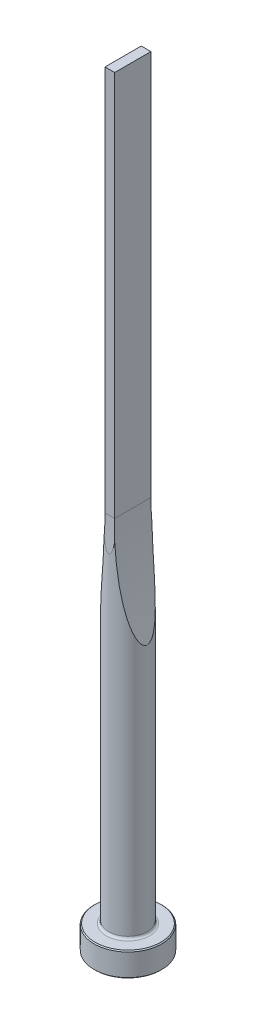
ISO-10303-21;
HEADER;
FILE_DESCRIPTION(('STEP AP214'),'2;1');
FILE_NAME('part.step','',(''),(''),'','','');
FILE_SCHEMA(('AUTOMOTIVE_DESIGN { 1 0 10303 214 1 1 1 1 }'));
ENDSEC;
DATA;
#1=APPLICATION_CONTEXT('core data for automotive mechanical design processes');
#2=APPLICATION_PROTOCOL_DEFINITION('international standard','automotive_design',2000,#1);
#3=PRODUCT_CONTEXT('',#1,'mechanical');
#4=PRODUCT('Part','Part','',(#3));
#5=PRODUCT_RELATED_PRODUCT_CATEGORY('part','',(#4));
#6=PRODUCT_DEFINITION_FORMATION('','',#4);
#7=PRODUCT_DEFINITION_CONTEXT('part definition',#1,'design');
#8=PRODUCT_DEFINITION('design','',#6,#7);
#9=PRODUCT_DEFINITION_SHAPE('','',#8);
#10=(LENGTH_UNIT() NAMED_UNIT(*) SI_UNIT(.MILLI.,.METRE.));
#11=(NAMED_UNIT(*) PLANE_ANGLE_UNIT() SI_UNIT($,.RADIAN.));
#12=(NAMED_UNIT(*) SI_UNIT($,.STERADIAN.) SOLID_ANGLE_UNIT());
#13=UNCERTAINTY_MEASURE_WITH_UNIT(LENGTH_MEASURE(1.E-05),#10,'distance_accuracy_value','');
#14=(GEOMETRIC_REPRESENTATION_CONTEXT(3) GLOBAL_UNCERTAINTY_ASSIGNED_CONTEXT((#13)) GLOBAL_UNIT_ASSIGNED_CONTEXT((#10,
#11,#12)) REPRESENTATION_CONTEXT('',''));
#15=CARTESIAN_POINT('',(0.,0.,0.));
#16=DIRECTION('',(0.,0.,1.));
#17=DIRECTION('',(1.,0.,0.));
#18=AXIS2_PLACEMENT_3D('',#15,#16,#17);
#19=CARTESIAN_POINT('',(0.,0.,0.));
#20=DIRECTION('',(0.,1.,0.));
#21=DIRECTION('',(-1.,0.,0.));
#22=AXIS2_PLACEMENT_3D('',#19,#20,#21);
#23=PLANE('',#22);
#24=CARTESIAN_POINT('',(0.,0.,0.));
#25=DIRECTION('',(0.,1.,0.));
#26=DIRECTION('',(-1.,0.,0.));
#27=AXIS2_PLACEMENT_3D('',#24,#25,#26);
#28=CIRCLE('',#27,6.8);
#29=CARTESIAN_POINT('',(-6.8,0.,0.));
#30=VERTEX_POINT('',#29);
#31=EDGE_CURVE('E133',#30,#30,#28,.T.);
#32=ORIENTED_EDGE('',*,*,#31,.F.);
#33=EDGE_LOOP('',(#32));
#34=FACE_BOUND('',#33,.T.);
#35=ADVANCED_FACE('F32',(#34),#23,.F.);
#36=CARTESIAN_POINT('',(0.,0.,0.));
#37=DIRECTION('',(0.,1.,0.));
#38=DIRECTION('',(-1.,0.,0.));
#39=AXIS2_PLACEMENT_3D('',#36,#37,#38);
#40=CONICAL_SURFACE('',#39,6.8,0.785398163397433);
#41=CARTESIAN_POINT('',(0.,0.200000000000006,0.));
#42=DIRECTION('',(0.,1.,0.));
#43=DIRECTION('',(-1.,0.,0.));
#44=AXIS2_PLACEMENT_3D('',#41,#42,#43);
#45=CIRCLE('',#44,7.);
#46=CARTESIAN_POINT('',(-7.,0.200000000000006,0.));
#47=VERTEX_POINT('',#46);
#48=EDGE_CURVE('E130',#47,#47,#45,.T.);
#49=ORIENTED_EDGE('',*,*,#48,.F.);
#50=EDGE_LOOP('',(#49));
#51=FACE_BOUND('',#50,.T.);
#52=ORIENTED_EDGE('',*,*,#31,.T.);
#53=EDGE_LOOP('',(#52));
#54=FACE_BOUND('',#53,.T.);
#55=ADVANCED_FACE('F171',(#51,#54),#40,.T.);
#56=CARTESIAN_POINT('',(0.,160.,0.));
#57=DIRECTION('',(0.,1.,0.));
#58=DIRECTION('',(-1.,0.,0.));
#59=AXIS2_PLACEMENT_3D('',#56,#57,#58);
#60=CYLINDRICAL_SURFACE('',#59,7.);
#61=CARTESIAN_POINT('',(0.,4.8,0.));
#62=DIRECTION('',(0.,1.,0.));
#63=DIRECTION('',(-1.,0.,0.));
#64=AXIS2_PLACEMENT_3D('',#61,#62,#63);
#65=CIRCLE('',#64,7.);
#66=CARTESIAN_POINT('',(-7.,4.8,0.));
#67=VERTEX_POINT('',#66);
#68=EDGE_CURVE('E127',#67,#67,#65,.T.);
#69=ORIENTED_EDGE('',*,*,#68,.F.);
#70=EDGE_LOOP('',(#69));
#71=FACE_BOUND('',#70,.T.);
#72=ORIENTED_EDGE('',*,*,#48,.T.);
#73=EDGE_LOOP('',(#72));
#74=FACE_BOUND('',#73,.T.);
#75=ADVANCED_FACE('F176',(#71,#74),#60,.T.);
#76=CARTESIAN_POINT('',(0.,4.8,0.));
#77=DIRECTION('',(0.,-1.,0.));
#78=DIRECTION('',(1.,0.,0.));
#79=AXIS2_PLACEMENT_3D('',#76,#77,#78);
#80=CONICAL_SURFACE('',#79,7.,0.785398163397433);
#81=CARTESIAN_POINT('',(0.,5.,0.));
#82=DIRECTION('',(0.,1.,0.));
#83=DIRECTION('',(-1.,0.,0.));
#84=AXIS2_PLACEMENT_3D('',#81,#82,#83);
#85=CIRCLE('',#84,6.8);
#86=CARTESIAN_POINT('',(-6.8,5.,0.));
#87=VERTEX_POINT('',#86);
#88=EDGE_CURVE('E124',#87,#87,#85,.T.);
#89=ORIENTED_EDGE('',*,*,#88,.F.);
#90=EDGE_LOOP('',(#89));
#91=FACE_BOUND('',#90,.T.);
#92=ORIENTED_EDGE('',*,*,#68,.T.);
#93=EDGE_LOOP('',(#92));
#94=FACE_BOUND('',#93,.T.);
#95=ADVANCED_FACE('F183',(#91,#94),#80,.T.);
#96=CARTESIAN_POINT('',(6.8,5.,0.));
#97=DIRECTION('',(0.,-1.,0.));
#98=DIRECTION('',(1.,0.,0.));
#99=AXIS2_PLACEMENT_3D('',#96,#97,#98);
#100=PLANE('',#99);
#101=CARTESIAN_POINT('',(0.,5.,0.));
#102=DIRECTION('',(0.,1.,0.));
#103=DIRECTION('',(-1.,0.,0.));
#104=AXIS2_PLACEMENT_3D('',#101,#102,#103);
#105=CIRCLE('',#104,4.50000000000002);
#106=CARTESIAN_POINT('',(-4.50000000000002,5.,0.));
#107=VERTEX_POINT('',#106);
#108=EDGE_CURVE('E121',#107,#107,#105,.T.);
#109=ORIENTED_EDGE('',*,*,#108,.F.);
#110=EDGE_LOOP('',(#109));
#111=FACE_BOUND('',#110,.T.);
#112=ORIENTED_EDGE('',*,*,#88,.T.);
#113=EDGE_LOOP('',(#112));
#114=FACE_BOUND('',#113,.T.);
#115=ADVANCED_FACE('F190',(#111,#114),#100,.F.);
#116=CARTESIAN_POINT('',(0.,5.5,0.));
#117=DIRECTION('',(0.,1.,0.));
#118=DIRECTION('',(-1.,0.,0.));
#119=AXIS2_PLACEMENT_3D('',#116,#117,#118);
#120=TOROIDAL_SURFACE('',#119,4.50000000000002,0.5);
#121=CARTESIAN_POINT('',(0.,5.50000000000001,0.));
#122=DIRECTION('',(0.,1.,0.));
#123=DIRECTION('',(-1.,0.,0.));
#124=AXIS2_PLACEMENT_3D('',#121,#122,#123);
#125=CIRCLE('',#124,4.00000000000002);
#126=CARTESIAN_POINT('',(-4.00000000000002,5.50000000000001,0.));
#127=VERTEX_POINT('',#126);
#128=EDGE_CURVE('E112',#127,#127,#125,.T.);
#129=ORIENTED_EDGE('',*,*,#128,.F.);
#130=EDGE_LOOP('',(#129));
#131=FACE_BOUND('',#130,.T.);
#132=ORIENTED_EDGE('',*,*,#108,.T.);
#133=EDGE_LOOP('',(#132));
#134=FACE_BOUND('',#133,.T.);
#135=ADVANCED_FACE('F168',(#131,#134),#120,.F.);
#136=CARTESIAN_POINT('',(0.,160.,0.));
#137=DIRECTION('',(0.,1.,0.));
#138=DIRECTION('',(-1.,0.,0.));
#139=AXIS2_PLACEMENT_3D('',#136,#137,#138);
#140=CYLINDRICAL_SURFACE('',#139,4.00000000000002);
#141=CARTESIAN_POINT('',(4.00000000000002,56.9565627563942,0.));
#142=CARTESIAN_POINT('',(3.99999908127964,56.9565661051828,0.0693234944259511));
#143=CARTESIAN_POINT('',(3.99817235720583,56.9634596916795,0.138657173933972));
#144=CARTESIAN_POINT('',(3.99114244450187,56.9900264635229,0.274681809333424));
#145=CARTESIAN_POINT('',(3.98593276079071,57.0097242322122,0.341367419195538));
#146=CARTESIAN_POINT('',(3.97135064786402,57.0649796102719,0.484371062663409));
#147=CARTESIAN_POINT('',(3.96131888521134,57.1030563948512,0.559625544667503));
#148=CARTESIAN_POINT('',(3.93842891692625,57.1902462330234,0.702905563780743));
#149=CARTESIAN_POINT('',(3.92556515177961,57.2393809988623,0.77091648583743));
#150=CARTESIAN_POINT('',(3.89970776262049,57.3385484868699,0.891965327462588));
#151=CARTESIAN_POINT('',(3.88693718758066,57.3876783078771,0.945808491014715));
#152=CARTESIAN_POINT('',(3.86037428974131,57.4902589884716,1.04897593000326));
#153=CARTESIAN_POINT('',(3.84658113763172,57.543713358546,1.09829646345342));
#154=CARTESIAN_POINT('',(3.81825138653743,57.6539498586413,1.19306609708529));
#155=CARTESIAN_POINT('',(3.80371318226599,57.710739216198,1.23850622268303));
#156=CARTESIAN_POINT('',(3.77413701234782,57.8267635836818,1.32590139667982));
#157=CARTESIAN_POINT('',(3.75909921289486,57.8859977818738,1.36785758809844));
#158=CARTESIAN_POINT('',(3.72120715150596,58.0359186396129,1.46859658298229));
#159=CARTESIAN_POINT('',(3.69813627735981,58.1277838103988,1.52554064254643));
#160=CARTESIAN_POINT('',(3.65154067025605,58.314614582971,1.63392905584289));
#161=CARTESIAN_POINT('',(3.6280157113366,58.4095817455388,1.68537058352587));
#162=CARTESIAN_POINT('',(3.58069701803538,58.6019791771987,1.78370145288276));
#163=CARTESIAN_POINT('',(3.55690289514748,58.6994133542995,1.83058291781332));
#164=CARTESIAN_POINT('',(3.50923075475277,58.8960774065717,1.92038432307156));
#165=CARTESIAN_POINT('',(3.4853527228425,58.9953076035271,1.96330354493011));
#166=CARTESIAN_POINT('',(3.41352667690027,59.2960810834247,2.08735367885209));
#167=CARTESIAN_POINT('',(3.36561636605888,59.4997748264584,2.16331575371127));
#168=CARTESIAN_POINT('',(3.29428173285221,59.8079687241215,2.26924886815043));
#169=CARTESIAN_POINT('',(3.27060420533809,59.9110877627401,2.30320927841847));
#170=CARTESIAN_POINT('',(3.22345187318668,60.118127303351,2.36875344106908));
#171=CARTESIAN_POINT('',(3.19997706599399,60.2220477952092,2.40033722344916));
#172=CARTESIAN_POINT('',(3.1322258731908,60.5244895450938,2.48887679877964));
#173=CARTESIAN_POINT('',(3.088261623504,60.7238941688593,2.54305671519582));
#174=CARTESIAN_POINT('',(3.00136468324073,61.1245602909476,2.64505001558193));
#175=CARTESIAN_POINT('',(2.95843214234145,61.3258220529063,2.69286248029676));
#176=CARTESIAN_POINT('',(2.87369595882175,61.7298832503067,2.78311065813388));
#177=CARTESIAN_POINT('',(2.83189286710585,61.9326833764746,2.82554378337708));
#178=CARTESIAN_POINT('',(2.74951474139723,62.3394527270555,2.90576401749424));
#179=CARTESIAN_POINT('',(2.70893977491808,62.5434220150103,2.94355087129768));
#180=CARTESIAN_POINT('',(2.58896832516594,63.1576796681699,3.05104054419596));
#181=CARTESIAN_POINT('',(2.51151492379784,63.5694143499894,3.11467696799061));
#182=CARTESIAN_POINT('',(2.36211591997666,64.3954588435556,3.22943230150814));
#183=CARTESIAN_POINT('',(2.29016893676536,64.8097679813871,3.28055435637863));
#184=CARTESIAN_POINT('',(2.15175693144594,65.6414535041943,3.37296310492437));
#185=CARTESIAN_POINT('',(2.08530598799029,66.0588349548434,3.41422502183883));
#186=CARTESIAN_POINT('',(1.95819345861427,66.8952058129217,3.48868104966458));
#187=CARTESIAN_POINT('',(1.89753217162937,67.3141953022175,3.52187474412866));
#188=CARTESIAN_POINT('',(1.78214714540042,68.1529036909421,3.58164270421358));
#189=CARTESIAN_POINT('',(1.72741586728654,68.5726209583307,3.60822543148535));
#190=CARTESIAN_POINT('',(1.62384822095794,69.413084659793,3.65600398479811));
#191=CARTESIAN_POINT('',(1.57501187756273,69.8338310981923,3.67719978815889));
#192=CARTESIAN_POINT('',(1.47580213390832,70.7446966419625,3.71824477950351));
#193=CARTESIAN_POINT('',(1.42647153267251,71.2349644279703,3.73731372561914));
#194=CARTESIAN_POINT('',(1.33585613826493,72.2164157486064,3.77065176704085));
#195=CARTESIAN_POINT('',(1.29457158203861,72.7075993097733,3.78492072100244));
#196=CARTESIAN_POINT('',(1.22006810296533,73.6907304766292,3.80958961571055));
#197=CARTESIAN_POINT('',(1.18685011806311,74.182678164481,3.81998910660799));
#198=CARTESIAN_POINT('',(1.12850115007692,75.1671100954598,3.83763118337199));
#199=CARTESIAN_POINT('',(1.10337020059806,75.6595943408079,3.84487375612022));
#200=CARTESIAN_POINT('',(1.06117886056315,76.6455641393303,3.85673174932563));
#201=CARTESIAN_POINT('',(1.04412872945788,77.1390501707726,3.86134383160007));
#202=CARTESIAN_POINT('',(1.01815247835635,78.1262528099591,3.86827428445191));
#203=CARTESIAN_POINT('',(1.00922637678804,78.6199694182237,3.87059264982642));
#204=CARTESIAN_POINT('',(0.999501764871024,79.6074463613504,3.87311520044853));
#205=CARTESIAN_POINT('',(0.998702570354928,80.1012066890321,3.8733195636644));
#206=CARTESIAN_POINT('',(1.00523032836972,81.0886790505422,3.87163059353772));
#207=CARTESIAN_POINT('',(1.01255742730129,81.5823910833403,3.86973722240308));
#208=CARTESIAN_POINT('',(1.03528419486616,82.5673920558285,3.86371897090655));
#209=CARTESIAN_POINT('',(1.05064737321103,83.0586818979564,3.8596041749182));
#210=CARTESIAN_POINT('',(1.08941871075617,84.0409076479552,3.84884036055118));
#211=CARTESIAN_POINT('',(1.11282671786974,84.5318435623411,3.84219139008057));
#212=CARTESIAN_POINT('',(1.16768273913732,85.5132905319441,3.82587724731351));
#213=CARTESIAN_POINT('',(1.19913195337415,86.00380151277,3.81621162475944));
#214=CARTESIAN_POINT('',(1.27005463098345,86.9841557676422,3.79319818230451));
#215=CARTESIAN_POINT('',(1.30952805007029,87.4739990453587,3.77985038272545));
#216=CARTESIAN_POINT('',(1.3964187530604,88.4521583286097,3.74861904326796));
#217=CARTESIAN_POINT('',(1.44382502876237,88.9404755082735,3.73074177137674));
#218=CARTESIAN_POINT('',(1.54658814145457,89.9160306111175,3.68932757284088));
#219=CARTESIAN_POINT('',(1.60194486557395,90.4032685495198,3.66579072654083));
#220=CARTESIAN_POINT('',(1.72054689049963,91.3762642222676,3.61164347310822));
#221=CARTESIAN_POINT('',(1.78379011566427,91.8620223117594,3.58103492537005));
#222=CARTESIAN_POINT('',(1.91810188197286,92.8317964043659,3.51093205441));
#223=CARTESIAN_POINT('',(1.98916982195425,93.3158125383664,3.47143841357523));
#224=CARTESIAN_POINT('',(2.10122535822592,94.038039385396,3.40392660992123));
#225=CARTESIAN_POINT('',(2.13930667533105,94.2771044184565,3.38016662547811));
#226=CARTESIAN_POINT('',(2.21734164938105,94.7545955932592,3.32949919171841));
#227=CARTESIAN_POINT('',(2.25729529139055,94.9930217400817,3.30259176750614));
#228=CARTESIAN_POINT('',(2.33906610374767,95.4692337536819,3.24519121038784));
#229=CARTESIAN_POINT('',(2.38088409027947,95.7070192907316,3.21469649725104));
#230=CARTESIAN_POINT('',(2.46633098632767,96.1817058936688,3.14961854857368));
#231=CARTESIAN_POINT('',(2.50995988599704,96.4186069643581,3.1150353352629));
#232=CARTESIAN_POINT('',(2.59920106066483,96.8925182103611,3.04097591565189));
#233=CARTESIAN_POINT('',(2.64482209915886,97.1295230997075,3.00147629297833));
#234=CARTESIAN_POINT('',(2.7377747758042,97.6022046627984,2.91693995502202));
#235=CARTESIAN_POINT('',(2.78510635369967,97.8378813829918,2.87190343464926));
#236=CARTESIAN_POINT('',(2.88134423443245,98.307372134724,2.77533816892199));
#237=CARTESIAN_POINT('',(2.93024917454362,98.5411875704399,2.7238149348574));
#238=CARTESIAN_POINT('',(3.02952417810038,99.0066299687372,2.61295390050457));
#239=CARTESIAN_POINT('',(3.07989403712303,99.2382572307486,2.55361718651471));
#240=CARTESIAN_POINT('',(3.18241500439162,99.7009772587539,2.42468436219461));
#241=CARTESIAN_POINT('',(3.23457918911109,99.9320394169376,2.35498797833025));
#242=CARTESIAN_POINT('',(3.33990650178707,100.390273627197,2.20309693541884));
#243=CARTESIAN_POINT('',(3.39307093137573,100.617439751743,2.12088483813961));
#244=CARTESIAN_POINT('',(3.47273982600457,100.952130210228,1.98563598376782));
#245=CARTESIAN_POINT('',(3.49916049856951,101.062186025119,1.93880953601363));
#246=CARTESIAN_POINT('',(3.5519150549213,101.280154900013,1.840387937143));
#247=CARTESIAN_POINT('',(3.57824895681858,101.388068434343,1.78879385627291));
#248=CARTESIAN_POINT('',(3.63057497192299,101.600822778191,1.68004710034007));
#249=CARTESIAN_POINT('',(3.65656774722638,101.705670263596,1.62290788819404));
#250=CARTESIAN_POINT('',(3.70796358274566,101.911448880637,1.50178061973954));
#251=CARTESIAN_POINT('',(3.73336706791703,102.012382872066,1.43779769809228));
#252=CARTESIAN_POINT('',(3.76958048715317,102.155271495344,1.3384146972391));
#253=CARTESIAN_POINT('',(3.78081713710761,102.199462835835,1.30638269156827));
#254=CARTESIAN_POINT('',(3.80299560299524,102.286418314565,1.2403376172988));
#255=CARTESIAN_POINT('',(3.81393737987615,102.32918226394,1.206324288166));
#256=CARTESIAN_POINT('',(3.84622039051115,102.454980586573,1.10091663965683));
#257=CARTESIAN_POINT('',(3.86700644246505,102.535470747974,1.0261889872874));
#258=CARTESIAN_POINT('',(3.90290257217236,102.673771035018,0.878722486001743));
#259=CARTESIAN_POINT('',(3.91838915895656,102.733150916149,0.807567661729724));
#260=CARTESIAN_POINT('',(3.94649013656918,102.840522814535,0.656561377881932));
#261=CARTESIAN_POINT('',(3.95911214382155,102.888545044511,0.576733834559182));
#262=CARTESIAN_POINT('',(3.97654860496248,102.954731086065,0.436218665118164));
#263=CARTESIAN_POINT('',(3.98256540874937,102.97751993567,0.377882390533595));
#264=CARTESIAN_POINT('',(3.99211051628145,103.013637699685,0.258155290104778));
#265=CARTESIAN_POINT('',(3.99564216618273,103.026979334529,0.19676869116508));
#266=CARTESIAN_POINT('',(3.99983907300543,103.042831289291,0.0720803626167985));
#267=CARTESIAN_POINT('',(4.00048616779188,103.045272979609,0.00876901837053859));
#268=CARTESIAN_POINT('',(3.99877838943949,103.038824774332,-0.117242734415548));
#269=CARTESIAN_POINT('',(3.99642227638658,103.02993019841,-0.179942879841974));
#270=CARTESIAN_POINT('',(3.98928141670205,103.002935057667,-0.298132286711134));
#271=CARTESIAN_POINT('',(3.98469267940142,102.985577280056,-0.35380919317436));
#272=CARTESIAN_POINT('',(3.97359466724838,102.943523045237,-0.462072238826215));
#273=CARTESIAN_POINT('',(3.96708467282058,102.918823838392,-0.514657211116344));
#274=CARTESIAN_POINT('',(3.9472182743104,102.843283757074,-0.653780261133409));
#275=CARTESIAN_POINT('',(3.93234499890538,102.78656583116,-0.736891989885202));
#276=CARTESIAN_POINT('',(3.89976659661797,102.661719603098,-0.893454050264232));
#277=CARTESIAN_POINT('',(3.88205151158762,102.593551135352,-0.966868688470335));
#278=CARTESIAN_POINT('',(3.84515803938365,102.450810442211,-1.10441932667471));
#279=CARTESIAN_POINT('',(3.82600386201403,102.376342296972,-1.16867176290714));
#280=CARTESIAN_POINT('',(3.78663004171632,102.222385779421,-1.29055678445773));
#281=CARTESIAN_POINT('',(3.76640931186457,102.142892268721,-1.34818241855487));
#282=CARTESIAN_POINT('',(3.72527346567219,101.980199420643,-1.45800523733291));
#283=CARTESIAN_POINT('',(3.70435700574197,101.896992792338,-1.51019100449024));
#284=CARTESIAN_POINT('',(3.66213788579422,101.727987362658,-1.60986556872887));
#285=CARTESIAN_POINT('',(3.64083541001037,101.642189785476,-1.65735654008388));
#286=CARTESIAN_POINT('',(3.58333461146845,101.409093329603,-1.77958680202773));
#287=CARTESIAN_POINT('',(3.54693304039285,101.259943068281,-1.85069466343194));
#288=CARTESIAN_POINT('',(3.4740261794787,100.957769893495,-1.98416277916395));
#289=CARTESIAN_POINT('',(3.43752084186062,100.804744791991,-2.04651795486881));
#290=CARTESIAN_POINT('',(3.36465781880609,100.495659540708,-2.16422609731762));
#291=CARTESIAN_POINT('',(3.3283005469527,100.339594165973,-2.21956550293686));
#292=CARTESIAN_POINT('',(3.25599936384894,100.025392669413,-2.32433091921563));
#293=CARTESIAN_POINT('',(3.2200555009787,99.8672563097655,-2.37375624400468));
#294=CARTESIAN_POINT('',(3.14853498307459,99.5485779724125,-2.46784011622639));
#295=CARTESIAN_POINT('',(3.11296114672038,99.3880278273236,-2.51247298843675));
#296=CARTESIAN_POINT('',(3.04246152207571,99.0656407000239,-2.59739704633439));
#297=CARTESIAN_POINT('',(3.00753576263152,98.9038036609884,-2.63768803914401));
#298=CARTESIAN_POINT('',(2.93844678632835,98.5792983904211,-2.71444158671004));
#299=CARTESIAN_POINT('',(2.90428263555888,98.4166315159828,-2.75090905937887));
#300=CARTESIAN_POINT('',(2.83672091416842,98.0904386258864,-2.82052506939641));
#301=CARTESIAN_POINT('',(2.80332332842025,97.9269126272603,-2.85367367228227));
#302=CARTESIAN_POINT('',(2.70147864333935,97.4210437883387,-2.95146748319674));
#303=CARTESIAN_POINT('',(2.63437939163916,97.0774742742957,-3.01119821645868));
#304=CARTESIAN_POINT('',(2.50391772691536,96.3880012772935,-3.12051465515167));
#305=CARTESIAN_POINT('',(2.44055587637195,96.0420974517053,-3.17009883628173));
#306=CARTESIAN_POINT('',(2.31768945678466,95.3483533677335,-3.26100537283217));
#307=CARTESIAN_POINT('',(2.25818681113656,95.0005122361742,-3.30232362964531));
#308=CARTESIAN_POINT('',(2.14316659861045,94.3034248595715,-3.37810211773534));
#309=CARTESIAN_POINT('',(2.08764916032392,93.9541785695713,-3.41256212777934));
#310=CARTESIAN_POINT('',(1.98054110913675,93.2537446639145,-3.47582142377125));
#311=CARTESIAN_POINT('',(1.92895986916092,92.902554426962,-3.50460744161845));
#312=CARTESIAN_POINT('',(1.82991060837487,92.1992332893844,-3.55732520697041));
#313=CARTESIAN_POINT('',(1.78244263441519,91.847102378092,-3.58125689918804));
#314=CARTESIAN_POINT('',(1.64628374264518,90.7897335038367,-3.64691345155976));
#315=CARTESIAN_POINT('',(1.56380501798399,90.0833047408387,-3.68251817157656));
#316=CARTESIAN_POINT('',(1.41559952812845,88.6683992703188,-3.74197834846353));
#317=CARTESIAN_POINT('',(1.34986900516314,87.9599230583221,-3.76583644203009));
#318=CARTESIAN_POINT('',(1.23521097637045,86.5413346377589,-3.80498659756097));
#319=CARTESIAN_POINT('',(1.1862845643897,85.8312223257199,-3.82027810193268));
#320=CARTESIAN_POINT('',(1.10533658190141,84.4107779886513,-3.84447711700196));
#321=CARTESIAN_POINT('',(1.07329506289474,83.7004472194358,-3.85339216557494));
#322=CARTESIAN_POINT('',(1.02605523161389,82.2792045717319,-3.86624049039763));
#323=CARTESIAN_POINT('',(1.01085628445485,81.5682927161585,-3.87017395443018));
#324=CARTESIAN_POINT('',(0.99932894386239,80.3582263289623,-3.87315713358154));
#325=CARTESIAN_POINT('',(0.998726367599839,79.8591104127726,-3.87331302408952));
#326=CARTESIAN_POINT('',(1.00582442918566,78.8609418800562,-3.87147723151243));
#327=CARTESIAN_POINT('',(1.01352501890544,78.3618892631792,-3.86948556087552));
#328=CARTESIAN_POINT('',(1.03722967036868,77.3638725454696,-3.86319865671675));
#329=CARTESIAN_POINT('',(1.05323578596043,76.8649084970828,-3.85890285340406));
#330=CARTESIAN_POINT('',(1.09354668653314,75.8673446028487,-3.84767388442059));
#331=CARTESIAN_POINT('',(1.11785146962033,75.3687447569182,-3.84074071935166));
#332=CARTESIAN_POINT('',(1.17470614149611,74.3728367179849,-3.82373444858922));
#333=CARTESIAN_POINT('',(1.2072433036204,73.8755277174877,-3.81366618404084));
#334=CARTESIAN_POINT('',(1.2805658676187,72.881612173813,-3.78967555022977));
#335=CARTESIAN_POINT('',(1.32135121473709,72.3850056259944,-3.77575320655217));
#336=CARTESIAN_POINT('',(1.41113931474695,71.3927858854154,-3.74312274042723));
#337=CARTESIAN_POINT('',(1.46014051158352,70.8971725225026,-3.72441552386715));
#338=CARTESIAN_POINT('',(1.56633082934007,69.9070977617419,-3.68101972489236));
#339=CARTESIAN_POINT('',(1.62351961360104,69.4126363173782,-3.65633138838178));
#340=CARTESIAN_POINT('',(1.72671298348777,68.5808823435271,-3.60840561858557));
#341=CARTESIAN_POINT('',(1.77055626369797,68.2432052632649,-3.58716639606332));
#342=CARTESIAN_POINT('',(1.8620318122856,67.5686496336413,-3.5405473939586));
#343=CARTESIAN_POINT('',(1.90966405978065,67.2317710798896,-3.5151676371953));
#344=CARTESIAN_POINT('',(2.00868306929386,66.5589765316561,-3.45954065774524));
#345=CARTESIAN_POINT('',(2.06006968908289,66.2230605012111,-3.42929361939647));
#346=CARTESIAN_POINT('',(2.16654882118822,65.5523963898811,-3.36303263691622));
#347=CARTESIAN_POINT('',(2.22164124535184,65.2176482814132,-3.327018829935));
#348=CARTESIAN_POINT('',(2.35670095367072,64.4249595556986,-3.23342990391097));
#349=CARTESIAN_POINT('',(2.43828227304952,63.9676361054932,-3.17282276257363));
#350=CARTESIAN_POINT('',(2.56559466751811,63.2844482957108,-3.06931357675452));
#351=CARTESIAN_POINT('',(2.6088599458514,63.0571634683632,-3.03270663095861));
#352=CARTESIAN_POINT('',(2.69697844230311,62.6037443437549,-2.95461990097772));
#353=CARTESIAN_POINT('',(2.74183160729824,62.3776100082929,-2.91314027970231));
#354=CARTESIAN_POINT('',(2.85075538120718,61.8392572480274,-2.80731366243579));
#355=CARTESIAN_POINT('',(2.91552855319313,61.5276895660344,-2.74033948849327));
#356=CARTESIAN_POINT('',(3.04764143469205,60.9085715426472,-2.59263375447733));
#357=CARTESIAN_POINT('',(3.11497908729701,60.6010182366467,-2.51191304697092));
#358=CARTESIAN_POINT('',(3.23134949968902,60.0823657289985,-2.35894677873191));
#359=CARTESIAN_POINT('',(3.27986780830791,59.869793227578,-2.29132479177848));
#360=CARTESIAN_POINT('',(3.37766837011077,59.4482650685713,-2.1445755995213));
#361=CARTESIAN_POINT('',(3.4269518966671,59.2393170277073,-2.06542683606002));
#362=CARTESIAN_POINT('',(3.50323968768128,58.9208540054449,-1.93138787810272));
#363=CARTESIAN_POINT('',(3.53023270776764,58.8091350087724,-1.88173006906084));
#364=CARTESIAN_POINT('',(3.58405466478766,58.588194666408,-1.77708328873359));
#365=CARTESIAN_POINT('',(3.61088364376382,58.4789726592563,-1.72209575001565));
#366=CARTESIAN_POINT('',(3.66405248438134,58.2642122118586,-1.60586223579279));
#367=CARTESIAN_POINT('',(3.69039359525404,58.1586634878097,-1.54463600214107));
#368=CARTESIAN_POINT('',(3.74226306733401,57.9523556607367,-1.41435283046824));
#369=CARTESIAN_POINT('',(3.7677921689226,57.851592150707,-1.34530330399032));
#370=CARTESIAN_POINT('',(3.81202336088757,57.67819629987,-1.21334596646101));
#371=CARTESIAN_POINT('',(3.8310066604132,57.6041974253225,-1.1523462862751));
#372=CARTESIAN_POINT('',(3.86759286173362,57.4622762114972,-1.02286989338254));
#373=CARTESIAN_POINT('',(3.88519303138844,57.3943658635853,-0.954378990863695));
#374=CARTESIAN_POINT('',(3.91836097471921,57.2669287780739,-0.807593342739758));
#375=CARTESIAN_POINT('',(3.9338964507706,57.2075343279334,-0.729173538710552));
#376=CARTESIAN_POINT('',(3.96115450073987,57.1036627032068,-0.562403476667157));
#377=CARTESIAN_POINT('',(3.97289362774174,57.0591207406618,-0.474098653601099));
#378=CARTESIAN_POINT('',(3.98760341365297,57.003405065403,-0.320570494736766));
#379=CARTESIAN_POINT('',(3.99219982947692,56.9860292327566,-0.257781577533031));
#380=CARTESIAN_POINT('',(3.99839643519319,56.9626145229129,-0.129995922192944));
#381=CARTESIAN_POINT('',(4.00000086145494,56.9565596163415,-0.0650024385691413));
#382=CARTESIAN_POINT('',(4.00000000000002,56.9565627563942,0.));
#383=B_SPLINE_CURVE_WITH_KNOTS('',3,(#141,#142,#143,#144,#145,#146,#147,#148,#149,#150,#151,
#152,#153,#154,#155,#156,#157,#158,#159,#160,#161,#162,#163,#164,#165,#166,#167,#168,#169,#170,
#171,#172,#173,#174,#175,#176,#177,#178,#179,#180,#181,#182,#183,#184,#185,#186,#187,#188,#189,
#190,#191,#192,#193,#194,#195,#196,#197,#198,#199,#200,#201,#202,#203,#204,#205,#206,#207,#208,
#209,#210,#211,#212,#213,#214,#215,#216,#217,#218,#219,#220,#221,#222,#223,#224,#225,#226,#227,
#228,#229,#230,#231,#232,#233,#234,#235,#236,#237,#238,#239,#240,#241,#242,#243,#244,#245,#246,
#247,#248,#249,#250,#251,#252,#253,#254,#255,#256,#257,#258,#259,#260,#261,#262,#263,#264,#265,
#266,#267,#268,#269,#270,#271,#272,#273,#274,#275,#276,#277,#278,#279,#280,#281,#282,#283,#284,
#285,#286,#287,#288,#289,#290,#291,#292,#293,#294,#295,#296,#297,#298,#299,#300,#301,#302,#303,
#304,#305,#306,#307,#308,#309,#310,#311,#312,#313,#314,#315,#316,#317,#318,#319,#320,#321,#322,
#323,#324,#325,#326,#327,#328,#329,#330,#331,#332,#333,#334,#335,#336,#337,#338,#339,#340,#341,
#342,#343,#344,#345,#346,#347,#348,#349,#350,#351,#352,#353,#354,#355,#356,#357,#358,#359,#360,
#361,#362,#363,#364,#365,#366,#367,#368,#369,#370,#371,#372,#373,#374,#375,#376,#377,#378,#379,
#380,#381,#382),.UNSPECIFIED.,.T.,.F.,(4,2,2,2,2,2,2,2,2,2,2,2,2,2,2,2,2,2,2,2,2,2,2,2,2,2,2,2,
2,2,2,2,2,2,2,2,2,2,2,2,2,2,2,2,2,2,2,2,2,2,2,2,2,2,2,2,2,2,2,2,2,2,2,2,2,2,2,2,2,2,2,2,2,2,2,2,
2,2,2,2,2,2,2,2,2,2,2,2,2,2,2,2,2,2,2,2,2,2,2,2,2,2,2,2,2,2,2,2,2,2,2,2,2,2,2,2,2,2,2,2,4),(0.,
0.207654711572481,0.415709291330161,0.669058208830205,0.922908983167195,1.14458973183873,
1.36645227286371,1.58881477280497,1.81110402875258,2.14240740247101,2.47388012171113,
2.80591559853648,3.1380111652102,3.80539132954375,4.13873386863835,4.47207219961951,
5.10570938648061,5.73943795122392,6.37347024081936,7.00753732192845,8.27850002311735,
9.54914297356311,10.8229460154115,12.0968147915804,13.3690446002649,14.6412797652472,
16.1205179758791,17.5997997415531,19.0792534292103,20.5587132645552,22.0400464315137,
23.5213829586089,25.0025947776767,26.4838332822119,27.9584034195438,29.432945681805,
30.9077081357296,32.382462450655,33.8551870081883,35.327890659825,36.8002075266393,
38.2724113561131,39.0021153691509,39.7318135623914,40.4618344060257,41.1918512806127,
41.9254887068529,42.6591003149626,43.3920927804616,44.1249834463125,44.8654956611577,
45.6070492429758,45.9744252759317,46.3417190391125,46.7081423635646,47.0742926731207,
47.2414153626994,47.4085600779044,47.7430365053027,48.0241616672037,48.304530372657,
48.4925925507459,48.680401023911,48.8693903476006,49.0584577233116,49.2333036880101,
49.4082152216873,49.7115824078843,50.0160368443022,50.3161898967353,50.616654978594,
50.9177385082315,51.2186819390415,51.7258716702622,52.2333544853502,52.7418037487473,
53.2503119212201,53.7614211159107,54.2725530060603,54.7830191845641,55.2934752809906,
56.3585947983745,57.4238742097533,58.4896805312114,59.5555212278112,60.6238254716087,
61.6921418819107,63.8281212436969,65.9636209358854,68.0992596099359,70.2323694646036,
72.3653989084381,73.86268010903,75.3599526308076,76.8575955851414,78.355238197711,
79.8505795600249,81.3459109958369,82.840959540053,84.3359466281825,85.3594253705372,
86.3828984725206,87.4063328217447,88.4297428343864,89.8348427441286,90.5375282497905,
91.2401902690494,92.2155496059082,93.1901424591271,93.8747780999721,94.5607110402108,
94.936213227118,95.3116147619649,95.6858632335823,96.0597600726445,96.352687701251,
96.6461801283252,96.9438272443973,97.2401584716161,97.4351459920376,97.6298572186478),.UNSPECIFIED.);
#384=CARTESIAN_POINT('',(1.09671499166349,75.8287478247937,-3.84671499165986));
#385=VERTEX_POINT('',#384);
#386=CARTESIAN_POINT('',(1.0967149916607,75.8287478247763,3.84671499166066));
#387=VERTEX_POINT('',#386);
#388=EDGE_CURVE('E138',#385,#387,#383,.T.);
#389=ORIENTED_EDGE('',*,*,#388,.T.);
#390=CARTESIAN_POINT('',(-1.39194109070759,80.,3.74999999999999));
#391=CARTESIAN_POINT('',(-1.39194449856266,80.3340996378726,3.7500000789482));
#392=CARTESIAN_POINT('',(-1.38695792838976,80.668209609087,3.75186098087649));
#393=CARTESIAN_POINT('',(-1.366673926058,81.3360771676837,3.75929815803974));
#394=CARTESIAN_POINT('',(-1.35137656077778,81.6698347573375,3.76487440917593));
#395=CARTESIAN_POINT('',(-1.30923320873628,82.3374065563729,3.77973662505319));
#396=CARTESIAN_POINT('',(-1.28235776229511,82.6712187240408,3.78903204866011));
#397=CARTESIAN_POINT('',(-1.21470251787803,83.3371930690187,3.81127649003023));
#398=CARTESIAN_POINT('',(-1.17393087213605,83.6693560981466,3.82422336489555));
#399=CARTESIAN_POINT('',(-1.09844611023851,84.1657630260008,3.84630718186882));
#400=CARTESIAN_POINT('',(-1.07085040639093,84.3311442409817,3.85412453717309));
#401=CARTESIAN_POINT('',(-1.00961852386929,84.6608992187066,3.87061811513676));
#402=CARTESIAN_POINT('',(-0.975977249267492,84.8252720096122,3.87929505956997));
#403=CARTESIAN_POINT('',(-0.900897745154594,85.1517938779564,3.89742276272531));
#404=CARTESIAN_POINT('',(-0.859480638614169,85.3139477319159,3.90687138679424));
#405=CARTESIAN_POINT('',(-0.788768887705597,85.5545158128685,3.92153114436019));
#406=CARTESIAN_POINT('',(-0.763786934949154,85.6342087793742,3.92649537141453));
#407=CARTESIAN_POINT('',(-0.710141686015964,85.7923268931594,3.93655330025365));
#408=CARTESIAN_POINT('',(-0.681479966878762,85.8707525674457,3.94164694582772));
#409=CARTESIAN_POINT('',(-0.619110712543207,86.0259141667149,3.95192410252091));
#410=CARTESIAN_POINT('',(-0.585384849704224,86.102642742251,3.9571078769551));
#411=CARTESIAN_POINT('',(-0.510918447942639,86.2524891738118,3.96741853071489));
#412=CARTESIAN_POINT('',(-0.470205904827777,86.3256199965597,3.97254555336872));
#413=CARTESIAN_POINT('',(-0.405871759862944,86.4217687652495,3.97939443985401));
#414=CARTESIAN_POINT('',(-0.387100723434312,86.4479908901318,3.98127456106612));
#415=CARTESIAN_POINT('',(-0.34734030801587,86.4988380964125,3.98494137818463));
#416=CARTESIAN_POINT('',(-0.326345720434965,86.5234591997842,3.98672783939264));
#417=CARTESIAN_POINT('',(-0.281381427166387,86.5704548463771,3.99015550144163));
#418=CARTESIAN_POINT('',(-0.257378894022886,86.5927987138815,3.99179469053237));
#419=CARTESIAN_POINT('',(-0.206002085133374,86.6332343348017,3.99477391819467));
#420=CARTESIAN_POINT('',(-0.178643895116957,86.6513452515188,3.99611530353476));
#421=CARTESIAN_POINT('',(-0.133196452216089,86.6742305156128,3.99781497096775));
#422=CARTESIAN_POINT('',(-0.116315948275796,86.681368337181,3.99834625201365));
#423=CARTESIAN_POINT('',(-0.0816311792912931,86.6928863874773,3.99920443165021));
#424=CARTESIAN_POINT('',(-0.0638281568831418,86.6972702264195,3.99953159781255));
#425=CARTESIAN_POINT('',(-0.0275781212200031,86.7028240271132,3.99994619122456));
#426=CARTESIAN_POINT('',(-0.00912739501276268,86.7039706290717,4.00003187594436));
#427=CARTESIAN_POINT('',(0.0276703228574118,86.7028293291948,3.99994663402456));
#428=CARTESIAN_POINT('',(0.0460172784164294,86.7005402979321,3.99977562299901));
#429=CARTESIAN_POINT('',(0.0805943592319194,86.6931273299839,3.99922251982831));
#430=CARTESIAN_POINT('',(0.0968774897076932,86.6882404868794,3.99885808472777));
#431=CARTESIAN_POINT('',(0.128581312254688,86.6762358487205,3.99796430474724));
#432=CARTESIAN_POINT('',(0.144001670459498,86.6691171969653,3.99743489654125));
#433=CARTESIAN_POINT('',(0.185006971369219,86.6471511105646,3.99580470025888));
#434=CARTESIAN_POINT('',(0.209611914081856,86.6304953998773,3.99457196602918));
#435=CARTESIAN_POINT('',(0.256071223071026,86.5937200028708,3.99186273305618));
#436=CARTESIAN_POINT('',(0.277915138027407,86.5735877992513,3.99038535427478));
#437=CARTESIAN_POINT('',(0.350665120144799,86.499085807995,3.98494736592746));
#438=CARTESIAN_POINT('',(0.395552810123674,86.4389897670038,3.98061079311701));
#439=CARTESIAN_POINT('',(0.476792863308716,86.3133434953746,3.97168524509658));
#440=CARTESIAN_POINT('',(0.513090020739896,86.2477614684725,3.967094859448));
#441=CARTESIAN_POINT('',(0.605299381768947,86.0631758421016,3.95438947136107));
#442=CARTESIAN_POINT('',(0.655314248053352,85.9412436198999,3.94623160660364));
#443=CARTESIAN_POINT('',(0.74537696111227,85.6936668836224,3.93019294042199));
#444=CARTESIAN_POINT('',(0.785397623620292,85.5680132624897,3.92231294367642));
#445=CARTESIAN_POINT('',(0.858576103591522,85.3143608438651,3.90694950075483));
#446=CARTESIAN_POINT('',(0.891716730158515,85.1863570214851,3.89946708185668));
#447=CARTESIAN_POINT('',(0.952763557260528,84.9292949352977,3.88499773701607));
#448=CARTESIAN_POINT('',(0.980676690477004,84.8002383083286,3.87801016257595));
#449=CARTESIAN_POINT('',(1.05809609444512,84.4130670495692,3.85789047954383));
#450=CARTESIAN_POINT('',(1.10161068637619,84.1537155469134,3.84552636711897));
#451=CARTESIAN_POINT('',(1.17739914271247,83.6332486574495,3.82298810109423));
#452=CARTESIAN_POINT('',(1.20966805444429,83.3721325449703,3.81281491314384));
#453=CARTESIAN_POINT('',(1.26533785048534,82.8484213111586,3.79470411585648));
#454=CARTESIAN_POINT('',(1.28872293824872,82.5858243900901,3.78677049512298));
#455=CARTESIAN_POINT('',(1.32794213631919,82.0599951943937,3.77319404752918));
#456=CARTESIAN_POINT('',(1.34377550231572,81.7967628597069,3.76755144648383));
#457=CARTESIAN_POINT('',(1.36866096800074,81.2703935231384,3.75858225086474));
#458=CARTESIAN_POINT('',(1.37772460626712,81.0072571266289,3.75525171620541));
#459=CARTESIAN_POINT('',(1.38952938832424,80.4808229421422,3.75089945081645));
#460=CARTESIAN_POINT('',(1.39227046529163,80.2175251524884,3.7498777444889));
#461=CARTESIAN_POINT('',(1.39154941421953,79.6912325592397,3.7501453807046));
#462=CARTESIAN_POINT('',(1.38809419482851,79.4282377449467,3.75143214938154));
#463=CARTESIAN_POINT('',(1.37484398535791,78.9024375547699,3.75630869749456));
#464=CARTESIAN_POINT('',(1.36504925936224,78.6396321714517,3.7598983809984));
#465=CARTESIAN_POINT('',(1.33880225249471,78.1170444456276,3.76932382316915));
#466=CARTESIAN_POINT('',(1.32241801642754,77.8572583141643,3.77513659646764));
#467=CARTESIAN_POINT('',(1.28217391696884,77.3382024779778,3.78899593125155));
#468=CARTESIAN_POINT('',(1.25831091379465,77.0789330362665,3.79704343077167));
#469=CARTESIAN_POINT('',(1.20163024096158,76.5608244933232,3.8153602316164));
#470=CARTESIAN_POINT('',(1.16879164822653,76.3019878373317,3.82563471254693));
#471=CARTESIAN_POINT('',(1.09180587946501,75.7862363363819,3.84832767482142));
#472=CARTESIAN_POINT('',(1.04766828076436,75.529320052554,3.86074433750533));
#473=CARTESIAN_POINT('',(0.969147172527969,75.1457963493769,3.88091053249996));
#474=CARTESIAN_POINT('',(0.940826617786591,75.0179166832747,3.88791072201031));
#475=CARTESIAN_POINT('',(0.878848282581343,74.7632801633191,3.90238986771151));
#476=CARTESIAN_POINT('',(0.845183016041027,74.6365251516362,3.90986948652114));
#477=CARTESIAN_POINT('',(0.770839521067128,74.3854811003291,3.92521002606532));
#478=CARTESIAN_POINT('',(0.730184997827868,74.2611852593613,3.93306959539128));
#479=CARTESIAN_POINT('',(0.661250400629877,74.0778844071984,3.94503185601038));
#480=CARTESIAN_POINT('',(0.636977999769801,74.0173732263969,3.94904355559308));
#481=CARTESIAN_POINT('',(0.584962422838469,73.8978769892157,3.95708454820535));
#482=CARTESIAN_POINT('',(0.557221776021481,73.8388908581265,3.96111382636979));
#483=CARTESIAN_POINT('',(0.496796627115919,73.7229032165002,3.96914753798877));
#484=CARTESIAN_POINT('',(0.464075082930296,73.6659208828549,3.97315152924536));
#485=CARTESIAN_POINT('',(0.391808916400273,73.5565882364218,3.98093309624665));
#486=CARTESIAN_POINT('',(0.352311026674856,73.5042096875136,3.98471199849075));
#487=CARTESIAN_POINT('',(0.291384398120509,73.4398387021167,3.98940404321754));
#488=CARTESIAN_POINT('',(0.274626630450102,73.4235001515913,3.99059997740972));
#489=CARTESIAN_POINT('',(0.239433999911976,73.3926348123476,3.99286679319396));
#490=CARTESIAN_POINT('',(0.220996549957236,73.3781109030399,3.99393747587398));
#491=CARTESIAN_POINT('',(0.18203801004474,73.3515121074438,3.99590377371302));
#492=CARTESIAN_POINT('',(0.161493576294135,73.3394704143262,3.99679701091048));
#493=CARTESIAN_POINT('',(0.118575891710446,73.3192603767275,3.99829905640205));
#494=CARTESIAN_POINT('',(0.0962092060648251,73.3110787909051,3.99890883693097));
#495=CARTESIAN_POINT('',(0.0565412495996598,73.3013407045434,3.99963520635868));
#496=CARTESIAN_POINT('',(0.0395386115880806,73.2985809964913,3.99984131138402));
#497=CARTESIAN_POINT('',(0.00530985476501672,73.2960145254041,4.00003297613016));
#498=CARTESIAN_POINT('',(-0.0119161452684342,73.2962062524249,4.00001864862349));
#499=CARTESIAN_POINT('',(-0.0460423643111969,73.2995172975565,3.99977139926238));
#500=CARTESIAN_POINT('',(-0.0629431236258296,73.3026312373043,3.99953887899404));
#501=CARTESIAN_POINT('',(-0.0960472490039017,73.3114519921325,3.99888109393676));
#502=CARTESIAN_POINT('',(-0.112249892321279,73.3171614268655,3.99845563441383));
#503=CARTESIAN_POINT('',(-0.151566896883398,73.3340811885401,3.99719710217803));
#504=CARTESIAN_POINT('',(-0.174103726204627,73.3466149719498,3.99626655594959));
#505=CARTESIAN_POINT('',(-0.216979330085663,73.3749765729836,3.9941686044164));
#506=CARTESIAN_POINT('',(-0.237311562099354,73.3908138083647,3.99300052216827));
#507=CARTESIAN_POINT('',(-0.293164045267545,73.4396828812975,3.98941150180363));
#508=CARTESIAN_POINT('',(-0.326182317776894,73.4755180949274,3.98679738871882));
#509=CARTESIAN_POINT('',(-0.387204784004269,73.5511526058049,3.98133154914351));
#510=CARTESIAN_POINT('',(-0.415192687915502,73.5909641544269,3.978479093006));
#511=CARTESIAN_POINT('',(-0.485402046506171,73.700793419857,3.97068874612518));
#512=CARTESIAN_POINT('',(-0.524314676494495,73.7728961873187,3.96565520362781));
#513=CARTESIAN_POINT('',(-0.595699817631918,73.9202694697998,3.95555476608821));
#514=CARTESIAN_POINT('',(-0.62815572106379,73.9955475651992,3.95048781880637));
#515=CARTESIAN_POINT('',(-0.688605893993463,74.1483373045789,3.94040179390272));
#516=CARTESIAN_POINT('',(-0.716575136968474,74.2258588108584,3.93538312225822));
#517=CARTESIAN_POINT('',(-0.768950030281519,74.3819705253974,3.92548292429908));
#518=CARTESIAN_POINT('',(-0.793360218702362,74.4605592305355,3.92060122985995));
#519=CARTESIAN_POINT('',(-0.867663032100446,74.7152944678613,3.90511793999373));
#520=CARTESIAN_POINT('',(-0.912146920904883,74.8930332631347,3.89483400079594));
#521=CARTESIAN_POINT('',(-0.992112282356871,75.2506061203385,3.87522370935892));
#522=CARTESIAN_POINT('',(-1.02758760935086,75.4304415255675,3.86589801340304));
#523=CARTESIAN_POINT('',(-1.09180429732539,75.7917615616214,3.84825637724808));
#524=CARTESIAN_POINT('',(-1.12053061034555,75.9732489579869,3.83994271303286));
#525=CARTESIAN_POINT('',(-1.17251616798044,76.3370581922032,3.82438612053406));
#526=CARTESIAN_POINT('',(-1.19577469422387,76.5193801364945,3.81714333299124));
#527=CARTESIAN_POINT('',(-1.25866381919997,77.0667778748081,3.79707123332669));
#528=CARTESIAN_POINT('',(-1.29147691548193,77.4327013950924,3.78587783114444));
#529=CARTESIAN_POINT('',(-1.34282300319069,78.1651770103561,3.76795987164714));
#530=CARTESIAN_POINT('',(-1.36137252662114,78.5317278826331,3.76123014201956));
#531=CARTESIAN_POINT('',(-1.37978686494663,79.0820898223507,3.7544936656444));
#532=CARTESIAN_POINT('',(-1.38435657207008,79.265735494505,3.75280785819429));
#533=CARTESIAN_POINT('',(-1.39043137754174,79.6329197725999,3.75056150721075));
#534=CARTESIAN_POINT('',(-1.39193921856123,79.8164583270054,3.74999995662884));
#535=CARTESIAN_POINT('',(-1.39194109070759,80.,3.74999999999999));
#536=B_SPLINE_CURVE_WITH_KNOTS('',3,(#390,#391,#392,#393,#394,#395,#396,#397,#398,#399,#400,
#401,#402,#403,#404,#405,#406,#407,#408,#409,#410,#411,#412,#413,#414,#415,#416,#417,#418,#419,
#420,#421,#422,#423,#424,#425,#426,#427,#428,#429,#430,#431,#432,#433,#434,#435,#436,#437,#438,
#439,#440,#441,#442,#443,#444,#445,#446,#447,#448,#449,#450,#451,#452,#453,#454,#455,#456,#457,
#458,#459,#460,#461,#462,#463,#464,#465,#466,#467,#468,#469,#470,#471,#472,#473,#474,#475,#476,
#477,#478,#479,#480,#481,#482,#483,#484,#485,#486,#487,#488,#489,#490,#491,#492,#493,#494,#495,
#496,#497,#498,#499,#500,#501,#502,#503,#504,#505,#506,#507,#508,#509,#510,#511,#512,#513,#514,
#515,#516,#517,#518,#519,#520,#521,#522,#523,#524,#525,#526,#527,#528,#529,#530,#531,#532,#533,
#534,#535),.UNSPECIFIED.,.T.,.F.,(4,2,2,2,2,2,2,2,2,2,2,2,2,2,2,2,2,2,2,2,2,2,2,2,2,2,2,2,2,2,2,
2,2,2,2,2,2,2,2,2,2,2,2,2,2,2,2,2,2,2,2,2,2,2,2,2,2,2,2,2,2,2,2,2,2,2,2,2,2,2,2,2,4),(0.,
1.00227413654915,2.00454177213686,3.00937481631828,4.01361938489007,4.51708131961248,
5.02096963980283,5.52350845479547,5.77444116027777,6.02526668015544,6.27702287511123,
6.5277928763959,6.62462106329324,6.72168130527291,6.81991213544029,6.91768924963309,
6.9725070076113,7.02725275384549,7.08239254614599,7.13755046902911,7.18837076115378,
7.2392105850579,7.32790198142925,7.41691964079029,7.64058495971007,7.86565080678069,
8.26074626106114,8.65690494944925,9.05404189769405,9.45064837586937,10.2400274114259,
11.0297536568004,11.8208776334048,12.6120795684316,13.4019298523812,14.1917884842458,
14.9807669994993,15.7697126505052,16.5507124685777,17.3320406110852,18.1152058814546,
18.8977095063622,19.2911173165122,19.6850810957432,20.0777341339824,20.2736272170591,
20.4693782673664,20.6666634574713,20.8626390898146,20.9328478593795,21.003166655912,
21.0743722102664,21.1453316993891,21.19677594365,21.2481938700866,21.299517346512,
21.3508927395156,21.427860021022,21.505049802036,21.6506217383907,21.7966569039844,
22.0422774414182,22.2885218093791,22.5360952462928,22.7833501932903,23.3334505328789,
23.8839251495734,24.4356157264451,24.987378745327,26.0896404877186,27.1906227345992,
27.7417280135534,28.2923394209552),.UNSPECIFIED.);
#537=CARTESIAN_POINT('',(-1.09671499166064,75.8287478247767,3.84671499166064));
#538=VERTEX_POINT('',#537);
#539=EDGE_CURVE('E104',#387,#538,#536,.T.);
#540=ORIENTED_EDGE('',*,*,#539,.T.);
#541=CARTESIAN_POINT('',(-4.00000000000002,56.956562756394,0.));
#542=CARTESIAN_POINT('',(-3.99999908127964,56.9565661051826,-0.0693234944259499));
#543=CARTESIAN_POINT('',(-3.99817235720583,56.9634596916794,-0.138657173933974));
#544=CARTESIAN_POINT('',(-3.99114244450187,56.9900264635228,-0.274681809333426));
#545=CARTESIAN_POINT('',(-3.98593276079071,57.0097242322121,-0.341367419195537));
#546=CARTESIAN_POINT('',(-3.97135064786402,57.0649796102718,-0.484371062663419));
#547=CARTESIAN_POINT('',(-3.96131888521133,57.103056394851,-0.559625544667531));
#548=CARTESIAN_POINT('',(-3.93842891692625,57.1902462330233,-0.702905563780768));
#549=CARTESIAN_POINT('',(-3.92556515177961,57.2393809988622,-0.770916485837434));
#550=CARTESIAN_POINT('',(-3.89970776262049,57.3385484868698,-0.89196532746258));
#551=CARTESIAN_POINT('',(-3.88693718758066,57.387678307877,-0.945808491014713));
#552=CARTESIAN_POINT('',(-3.86037428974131,57.4902589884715,-1.04897593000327));
#553=CARTESIAN_POINT('',(-3.84658113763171,57.5437133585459,-1.09829646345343));
#554=CARTESIAN_POINT('',(-3.81825138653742,57.6539498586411,-1.1930660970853));
#555=CARTESIAN_POINT('',(-3.80371318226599,57.7107392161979,-1.23850622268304));
#556=CARTESIAN_POINT('',(-3.77413701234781,57.8267635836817,-1.32590139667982));
#557=CARTESIAN_POINT('',(-3.75909921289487,57.8859977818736,-1.36785758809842));
#558=CARTESIAN_POINT('',(-3.72120715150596,58.0359186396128,-1.46859658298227));
#559=CARTESIAN_POINT('',(-3.69813627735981,58.1277838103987,-1.52554064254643));
#560=CARTESIAN_POINT('',(-3.65154067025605,58.3146145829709,-1.63392905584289));
#561=CARTESIAN_POINT('',(-3.6280157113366,58.4095817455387,-1.68537058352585));
#562=CARTESIAN_POINT('',(-3.58069701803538,58.6019791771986,-1.78370145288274));
#563=CARTESIAN_POINT('',(-3.55690289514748,58.6994133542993,-1.83058291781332));
#564=CARTESIAN_POINT('',(-3.50923075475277,58.8960774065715,-1.92038432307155));
#565=CARTESIAN_POINT('',(-3.48535272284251,58.9953076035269,-1.96330354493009));
#566=CARTESIAN_POINT('',(-3.41352667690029,59.2960810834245,-2.08735367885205));
#567=CARTESIAN_POINT('',(-3.3656163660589,59.4997748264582,-2.16331575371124));
#568=CARTESIAN_POINT('',(-3.29428173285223,59.8079687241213,-2.26924886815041));
#569=CARTESIAN_POINT('',(-3.2706042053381,59.9110877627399,-2.30320927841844));
#570=CARTESIAN_POINT('',(-3.2234518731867,60.1181273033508,-2.36875344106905));
#571=CARTESIAN_POINT('',(-3.19997706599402,60.222047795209,-2.40033722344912));
#572=CARTESIAN_POINT('',(-3.13222587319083,60.5244895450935,-2.48887679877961));
#573=CARTESIAN_POINT('',(-3.08826162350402,60.723894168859,-2.5430567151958));
#574=CARTESIAN_POINT('',(-3.00136468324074,61.1245602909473,-2.64505001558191));
#575=CARTESIAN_POINT('',(-2.95843214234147,61.3258220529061,-2.69286248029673));
#576=CARTESIAN_POINT('',(-2.87369595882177,61.7298832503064,-2.78311065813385));
#577=CARTESIAN_POINT('',(-2.83189286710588,61.9326833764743,-2.82554378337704));
#578=CARTESIAN_POINT('',(-2.74951474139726,62.3394527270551,-2.90576401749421));
#579=CARTESIAN_POINT('',(-2.70893977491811,62.5434220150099,-2.94355087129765));
#580=CARTESIAN_POINT('',(-2.58896832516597,63.1576796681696,-3.05104054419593));
#581=CARTESIAN_POINT('',(-2.51151492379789,63.5694143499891,-3.11467696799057));
#582=CARTESIAN_POINT('',(-2.36211591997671,64.3954588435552,-3.2294323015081));
#583=CARTESIAN_POINT('',(-2.2901689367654,64.8097679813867,-3.2805543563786));
#584=CARTESIAN_POINT('',(-2.15175693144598,65.6414535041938,-3.37296310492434));
#585=CARTESIAN_POINT('',(-2.08530598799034,66.0588349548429,-3.4142250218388));
#586=CARTESIAN_POINT('',(-1.95819345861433,66.8952058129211,-3.48868104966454));
#587=CARTESIAN_POINT('',(-1.89753217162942,67.3141953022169,-3.52187474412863));
#588=CARTESIAN_POINT('',(-1.78214714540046,68.1529036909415,-3.58164270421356));
#589=CARTESIAN_POINT('',(-1.72741586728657,68.57262095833,-3.60822543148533));
#590=CARTESIAN_POINT('',(-1.62384822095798,69.4130846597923,-3.6560039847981));
#591=CARTESIAN_POINT('',(-1.57501187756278,69.8338310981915,-3.67719978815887));
#592=CARTESIAN_POINT('',(-1.47580213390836,70.7446966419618,-3.71824477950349));
#593=CARTESIAN_POINT('',(-1.42647153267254,71.2349644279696,-3.73731372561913));
#594=CARTESIAN_POINT('',(-1.33585613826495,72.2164157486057,-3.77065176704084));
#595=CARTESIAN_POINT('',(-1.29457158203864,72.7075993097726,-3.78492072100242));
#596=CARTESIAN_POINT('',(-1.22006810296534,73.6907304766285,-3.80958961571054));
#597=CARTESIAN_POINT('',(-1.1868501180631,74.1826781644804,-3.819989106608));
#598=CARTESIAN_POINT('',(-1.1285011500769,75.1671100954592,-3.83763118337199));
#599=CARTESIAN_POINT('',(-1.10337020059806,75.6595943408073,-3.84487375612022));
#600=CARTESIAN_POINT('',(-1.06117886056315,76.6455641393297,-3.85673174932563));
#601=CARTESIAN_POINT('',(-1.04412872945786,77.139050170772,-3.86134383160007));
#602=CARTESIAN_POINT('',(-1.01815247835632,78.1262528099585,-3.86827428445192));
#603=CARTESIAN_POINT('',(-1.00922637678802,78.6199694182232,-3.87059264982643));
#604=CARTESIAN_POINT('',(-0.999501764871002,79.6074463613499,-3.87311520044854));
#605=CARTESIAN_POINT('',(-0.998702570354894,80.1012066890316,-3.8733195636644));
#606=CARTESIAN_POINT('',(-1.00523032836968,81.0886790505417,-3.87163059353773));
#607=CARTESIAN_POINT('',(-1.01255742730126,81.5823910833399,-3.86973722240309));
#608=CARTESIAN_POINT('',(-1.03528419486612,82.5673920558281,-3.86371897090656));
#609=CARTESIAN_POINT('',(-1.05064737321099,83.058681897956,-3.85960417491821));
#610=CARTESIAN_POINT('',(-1.08941871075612,84.0409076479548,-3.84884036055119));
#611=CARTESIAN_POINT('',(-1.11282671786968,84.5318435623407,-3.84219139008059));
#612=CARTESIAN_POINT('',(-1.16768273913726,85.5132905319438,-3.82587724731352));
#613=CARTESIAN_POINT('',(-1.1991319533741,86.0038015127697,-3.81621162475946));
#614=CARTESIAN_POINT('',(-1.2700546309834,86.9841557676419,-3.79319818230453));
#615=CARTESIAN_POINT('',(-1.30952805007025,87.4739990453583,-3.77985038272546));
#616=CARTESIAN_POINT('',(-1.39641875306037,88.4521583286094,-3.74861904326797));
#617=CARTESIAN_POINT('',(-1.44382502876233,88.9404755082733,-3.73074177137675));
#618=CARTESIAN_POINT('',(-1.54658814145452,89.9160306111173,-3.68932757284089));
#619=CARTESIAN_POINT('',(-1.6019448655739,90.4032685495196,-3.66579072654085));
#620=CARTESIAN_POINT('',(-1.72054689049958,91.3762642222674,-3.61164347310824));
#621=CARTESIAN_POINT('',(-1.78379011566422,91.8620223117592,-3.58103492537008));
#622=CARTESIAN_POINT('',(-1.9181018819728,92.8317964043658,-3.51093205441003));
#623=CARTESIAN_POINT('',(-1.9891698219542,93.3158125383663,-3.47143841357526));
#624=CARTESIAN_POINT('',(-2.10122535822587,94.0380393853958,-3.40392660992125));
#625=CARTESIAN_POINT('',(-2.139306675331,94.2771044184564,-3.38016662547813));
#626=CARTESIAN_POINT('',(-2.217341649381,94.7545955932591,-3.32949919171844));
#627=CARTESIAN_POINT('',(-2.25729529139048,94.9930217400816,-3.30259176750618));
#628=CARTESIAN_POINT('',(-2.33906610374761,95.4692337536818,-3.24519121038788));
#629=CARTESIAN_POINT('',(-2.38088409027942,95.7070192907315,-3.21469649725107));
#630=CARTESIAN_POINT('',(-2.46633098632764,96.1817058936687,-3.1496185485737));
#631=CARTESIAN_POINT('',(-2.509959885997,96.4186069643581,-3.11503533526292));
#632=CARTESIAN_POINT('',(-2.59920106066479,96.892518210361,-3.04097591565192));
#633=CARTESIAN_POINT('',(-2.64482209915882,97.1295230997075,-3.00147629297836));
#634=CARTESIAN_POINT('',(-2.73777477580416,97.6022046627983,-2.91693995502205));
#635=CARTESIAN_POINT('',(-2.78510635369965,97.8378813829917,-2.87190343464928));
#636=CARTESIAN_POINT('',(-2.88134423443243,98.3073721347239,-2.775338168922));
#637=CARTESIAN_POINT('',(-2.93024917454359,98.5411875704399,-2.72381493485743));
#638=CARTESIAN_POINT('',(-3.02952417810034,99.0066299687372,-2.6129539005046));
#639=CARTESIAN_POINT('',(-3.079894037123,99.2382572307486,-2.55361718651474));
#640=CARTESIAN_POINT('',(-3.18241500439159,99.7009772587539,-2.42468436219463));
#641=CARTESIAN_POINT('',(-3.23457918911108,99.9320394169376,-2.35498797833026));
#642=CARTESIAN_POINT('',(-3.33990650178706,100.390273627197,-2.20309693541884));
#643=CARTESIAN_POINT('',(-3.39307093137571,100.617439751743,-2.12088483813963));
#644=CARTESIAN_POINT('',(-3.47273982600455,100.952130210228,-1.98563598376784));
#645=CARTESIAN_POINT('',(-3.49916049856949,101.062186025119,-1.93880953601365));
#646=CARTESIAN_POINT('',(-3.55191505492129,101.280154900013,-1.84038793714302));
#647=CARTESIAN_POINT('',(-3.57824895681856,101.388068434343,-1.78879385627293));
#648=CARTESIAN_POINT('',(-3.63057497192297,101.600822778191,-1.6800471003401));
#649=CARTESIAN_POINT('',(-3.65656774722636,101.705670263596,-1.62290788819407));
#650=CARTESIAN_POINT('',(-3.70796358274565,101.911448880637,-1.50178061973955));
#651=CARTESIAN_POINT('',(-3.73336706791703,102.012382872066,-1.43779769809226));
#652=CARTESIAN_POINT('',(-3.76958048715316,102.155271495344,-1.3384146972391));
#653=CARTESIAN_POINT('',(-3.78081713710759,102.199462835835,-1.30638269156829));
#654=CARTESIAN_POINT('',(-3.80299560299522,102.286418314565,-1.24033761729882));
#655=CARTESIAN_POINT('',(-3.81393737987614,102.32918226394,-1.20632428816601));
#656=CARTESIAN_POINT('',(-3.84622039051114,102.454980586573,-1.10091663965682));
#657=CARTESIAN_POINT('',(-3.86700644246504,102.535470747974,-1.0261889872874));
#658=CARTESIAN_POINT('',(-3.90290257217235,102.673771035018,-0.878722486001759));
#659=CARTESIAN_POINT('',(-3.91838915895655,102.733150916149,-0.807567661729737));
#660=CARTESIAN_POINT('',(-3.94649013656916,102.840522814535,-0.656561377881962));
#661=CARTESIAN_POINT('',(-3.95911214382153,102.888545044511,-0.576733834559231));
#662=CARTESIAN_POINT('',(-3.97654860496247,102.954731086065,-0.436218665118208));
#663=CARTESIAN_POINT('',(-3.98256540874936,102.97751993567,-0.377882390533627));
#664=CARTESIAN_POINT('',(-3.99211051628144,103.013637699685,-0.258155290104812));
#665=CARTESIAN_POINT('',(-3.99564216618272,103.026979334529,-0.196768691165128));
#666=CARTESIAN_POINT('',(-3.99983907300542,103.042831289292,-0.0720803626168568));
#667=CARTESIAN_POINT('',(-4.00048616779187,103.045272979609,-0.00876901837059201));
#668=CARTESIAN_POINT('',(-3.99877838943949,103.038824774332,0.117242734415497));
#669=CARTESIAN_POINT('',(-3.99642227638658,103.02993019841,0.179942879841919));
#670=CARTESIAN_POINT('',(-3.98928141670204,103.002935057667,0.298132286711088));
#671=CARTESIAN_POINT('',(-3.98469267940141,102.985577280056,0.353809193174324));
#672=CARTESIAN_POINT('',(-3.97359466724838,102.943523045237,0.462072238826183));
#673=CARTESIAN_POINT('',(-3.96708467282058,102.918823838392,0.514657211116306));
#674=CARTESIAN_POINT('',(-3.94721827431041,102.843283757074,0.653780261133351));
#675=CARTESIAN_POINT('',(-3.93234499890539,102.78656583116,0.736891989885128));
#676=CARTESIAN_POINT('',(-3.89976659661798,102.661719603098,0.893454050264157));
#677=CARTESIAN_POINT('',(-3.88205151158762,102.593551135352,0.966868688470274));
#678=CARTESIAN_POINT('',(-3.84515803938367,102.450810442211,1.10441932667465));
#679=CARTESIAN_POINT('',(-3.82600386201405,102.376342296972,1.16867176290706));
#680=CARTESIAN_POINT('',(-3.78663004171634,102.222385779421,1.29055678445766));
#681=CARTESIAN_POINT('',(-3.76640931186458,102.142892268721,1.34818241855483));
#682=CARTESIAN_POINT('',(-3.72527346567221,101.980199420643,1.45800523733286));
#683=CARTESIAN_POINT('',(-3.70435700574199,101.896992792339,1.51019100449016));
#684=CARTESIAN_POINT('',(-3.66213788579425,101.727987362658,1.60986556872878));
#685=CARTESIAN_POINT('',(-3.6408354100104,101.642189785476,1.65735654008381));
#686=CARTESIAN_POINT('',(-3.58333461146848,101.409093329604,1.77958680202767));
#687=CARTESIAN_POINT('',(-3.54693304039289,101.259943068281,1.85069466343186));
#688=CARTESIAN_POINT('',(-3.47402617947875,100.957769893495,1.98416277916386));
#689=CARTESIAN_POINT('',(-3.43752084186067,100.804744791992,2.04651795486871));
#690=CARTESIAN_POINT('',(-3.36465781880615,100.495659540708,2.16422609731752));
#691=CARTESIAN_POINT('',(-3.32830054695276,100.339594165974,2.21956550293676));
#692=CARTESIAN_POINT('',(-3.25599936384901,100.025392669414,2.32433091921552));
#693=CARTESIAN_POINT('',(-3.22005550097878,99.8672563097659,2.37375624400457));
#694=CARTESIAN_POINT('',(-3.14853498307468,99.548577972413,2.46784011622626));
#695=CARTESIAN_POINT('',(-3.11296114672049,99.3880278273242,2.51247298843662));
#696=CARTESIAN_POINT('',(-3.04246152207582,99.0656407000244,2.59739704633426));
#697=CARTESIAN_POINT('',(-3.00753576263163,98.903803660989,2.63768803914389));
#698=CARTESIAN_POINT('',(-2.93844678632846,98.5792983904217,2.71444158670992));
#699=CARTESIAN_POINT('',(-2.90428263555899,98.4166315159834,2.75090905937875));
#700=CARTESIAN_POINT('',(-2.83672091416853,98.090438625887,2.82052506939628));
#701=CARTESIAN_POINT('',(-2.80332332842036,97.926912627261,2.85367367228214));
#702=CARTESIAN_POINT('',(-2.70147864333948,97.4210437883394,2.95146748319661));
#703=CARTESIAN_POINT('',(-2.63437939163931,97.0774742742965,3.01119821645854));
#704=CARTESIAN_POINT('',(-2.5039177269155,96.3880012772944,3.12051465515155));
#705=CARTESIAN_POINT('',(-2.44055587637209,96.0420974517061,3.17009883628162));
#706=CARTESIAN_POINT('',(-2.31768945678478,95.3483533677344,3.26100537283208));
#707=CARTESIAN_POINT('',(-2.25818681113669,95.0005122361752,3.30232362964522));
#708=CARTESIAN_POINT('',(-2.14316659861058,94.3034248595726,3.37810211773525));
#709=CARTESIAN_POINT('',(-2.08764916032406,93.9541785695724,3.41256212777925));
#710=CARTESIAN_POINT('',(-1.9805411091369,93.2537446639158,3.47582142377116));
#711=CARTESIAN_POINT('',(-1.92895986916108,92.9025544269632,3.50460744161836));
#712=CARTESIAN_POINT('',(-1.82991060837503,92.1992332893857,3.55732520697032));
#713=CARTESIAN_POINT('',(-1.78244263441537,91.8471023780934,3.58125689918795));
#714=CARTESIAN_POINT('',(-1.64628374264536,90.7897335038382,3.64691345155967));
#715=CARTESIAN_POINT('',(-1.56380501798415,90.0833047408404,3.68251817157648));
#716=CARTESIAN_POINT('',(-1.41559952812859,88.6683992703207,3.74197834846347));
#717=CARTESIAN_POINT('',(-1.34986900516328,87.9599230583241,3.76583644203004));
#718=CARTESIAN_POINT('',(-1.23521097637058,86.541334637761,3.80498659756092));
#719=CARTESIAN_POINT('',(-1.18628456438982,85.8312223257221,3.82027810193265));
#720=CARTESIAN_POINT('',(-1.10533658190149,84.4107779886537,3.84447711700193));
#721=CARTESIAN_POINT('',(-1.0732950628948,83.7004472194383,3.85339216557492));
#722=CARTESIAN_POINT('',(-1.02605523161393,82.2792045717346,3.86624049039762));
#723=CARTESIAN_POINT('',(-1.01085628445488,81.5682927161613,3.87017395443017));
#724=CARTESIAN_POINT('',(-0.999328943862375,80.3582263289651,3.87315713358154));
#725=CARTESIAN_POINT('',(-0.998726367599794,79.8591104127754,3.87331302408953));
#726=CARTESIAN_POINT('',(-1.00582442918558,78.8609418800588,3.87147723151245));
#727=CARTESIAN_POINT('',(-1.01352501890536,78.3618892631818,3.86948556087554));
#728=CARTESIAN_POINT('',(-1.03722967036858,77.3638725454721,3.86319865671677));
#729=CARTESIAN_POINT('',(-1.05323578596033,76.8649084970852,3.85890285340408));
#730=CARTESIAN_POINT('',(-1.09354668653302,75.8673446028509,3.84767388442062));
#731=CARTESIAN_POINT('',(-1.1178514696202,75.3687447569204,3.8407407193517));
#732=CARTESIAN_POINT('',(-1.17470614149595,74.372836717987,3.82373444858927));
#733=CARTESIAN_POINT('',(-1.20724330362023,73.8755277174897,3.81366618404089));
#734=CARTESIAN_POINT('',(-1.28056586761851,72.881612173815,3.78967555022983));
#735=CARTESIAN_POINT('',(-1.3213512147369,72.3850056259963,3.77575320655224));
#736=CARTESIAN_POINT('',(-1.41113931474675,71.3927858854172,3.7431227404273));
#737=CARTESIAN_POINT('',(-1.46014051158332,70.8971725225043,3.72441552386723));
#738=CARTESIAN_POINT('',(-1.56633082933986,69.9070977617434,3.68101972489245));
#739=CARTESIAN_POINT('',(-1.62351961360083,69.4126363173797,3.65633138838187));
#740=CARTESIAN_POINT('',(-1.72671298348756,68.5808823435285,3.60840561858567));
#741=CARTESIAN_POINT('',(-1.77055626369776,68.2432052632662,3.58716639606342));
#742=CARTESIAN_POINT('',(-1.8620318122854,67.5686496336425,3.5405473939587));
#743=CARTESIAN_POINT('',(-1.90966405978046,67.2317710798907,3.5151676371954));
#744=CARTESIAN_POINT('',(-2.00868306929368,66.5589765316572,3.45954065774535));
#745=CARTESIAN_POINT('',(-2.0600696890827,66.2230605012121,3.42929361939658));
#746=CARTESIAN_POINT('',(-2.16654882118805,65.552396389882,3.36303263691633));
#747=CARTESIAN_POINT('',(-2.22164124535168,65.217648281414,3.3270188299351));
#748=CARTESIAN_POINT('',(-2.35670095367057,64.4249595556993,3.23342990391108));
#749=CARTESIAN_POINT('',(-2.43828227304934,63.9676361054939,3.17282276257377));
#750=CARTESIAN_POINT('',(-2.56559466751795,63.2844482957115,3.06931357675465));
#751=CARTESIAN_POINT('',(-2.60885994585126,63.0571634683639,3.03270663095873));
#752=CARTESIAN_POINT('',(-2.69697844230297,62.6037443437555,2.95461990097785));
#753=CARTESIAN_POINT('',(-2.74183160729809,62.3776100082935,2.91314027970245));
#754=CARTESIAN_POINT('',(-2.85075538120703,61.839257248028,2.80731366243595));
#755=CARTESIAN_POINT('',(-2.91552855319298,61.5276895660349,2.74033948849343));
#756=CARTESIAN_POINT('',(-3.04764143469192,60.9085715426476,2.59263375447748));
#757=CARTESIAN_POINT('',(-3.11497908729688,60.6010182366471,2.51191304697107));
#758=CARTESIAN_POINT('',(-3.2313494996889,60.0823657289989,2.35894677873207));
#759=CARTESIAN_POINT('',(-3.27986780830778,59.8697932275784,2.29132479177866));
#760=CARTESIAN_POINT('',(-3.37766837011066,59.4482650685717,2.14457559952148));
#761=CARTESIAN_POINT('',(-3.426951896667,59.2393170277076,2.06542683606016));
#762=CARTESIAN_POINT('',(-3.50323968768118,58.9208540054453,1.93138787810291));
#763=CARTESIAN_POINT('',(-3.53023270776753,58.8091350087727,1.88173006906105));
#764=CARTESIAN_POINT('',(-3.58405466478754,58.5881946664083,1.77708328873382));
#765=CARTESIAN_POINT('',(-3.61088364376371,58.4789726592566,1.72209575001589));
#766=CARTESIAN_POINT('',(-3.66405248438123,58.2642122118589,1.60586223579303));
#767=CARTESIAN_POINT('',(-3.69039359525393,58.15866348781,1.54463600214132));
#768=CARTESIAN_POINT('',(-3.7422630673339,57.952355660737,1.4143528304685));
#769=CARTESIAN_POINT('',(-3.7677921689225,57.8515921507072,1.34530330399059));
#770=CARTESIAN_POINT('',(-3.81202336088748,57.6781962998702,1.21334596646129));
#771=CARTESIAN_POINT('',(-3.83100666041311,57.6041974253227,1.15234628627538));
#772=CARTESIAN_POINT('',(-3.86759286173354,57.4622762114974,1.02286989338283));
#773=CARTESIAN_POINT('',(-3.88519303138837,57.3943658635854,0.954378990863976));
#774=CARTESIAN_POINT('',(-3.91836097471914,57.266928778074,0.807593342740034));
#775=CARTESIAN_POINT('',(-3.93389645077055,57.2075343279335,0.729173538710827));
#776=CARTESIAN_POINT('',(-3.96115450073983,57.1036627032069,0.562403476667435));
#777=CARTESIAN_POINT('',(-3.9728936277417,57.0591207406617,0.474098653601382));
#778=CARTESIAN_POINT('',(-3.98760341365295,57.0034050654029,0.320570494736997));
#779=CARTESIAN_POINT('',(-3.9921998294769,56.9860292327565,0.257781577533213));
#780=CARTESIAN_POINT('',(-3.99839643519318,56.9626145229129,0.129995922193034));
#781=CARTESIAN_POINT('',(-4.00000086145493,56.9565596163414,0.0650024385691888));
#782=CARTESIAN_POINT('',(-4.00000000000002,56.956562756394,0.));
#783=B_SPLINE_CURVE_WITH_KNOTS('',3,(#541,#542,#543,#544,#545,#546,#547,#548,#549,#550,#551,
#552,#553,#554,#555,#556,#557,#558,#559,#560,#561,#562,#563,#564,#565,#566,#567,#568,#569,#570,
#571,#572,#573,#574,#575,#576,#577,#578,#579,#580,#581,#582,#583,#584,#585,#586,#587,#588,#589,
#590,#591,#592,#593,#594,#595,#596,#597,#598,#599,#600,#601,#602,#603,#604,#605,#606,#607,#608,
#609,#610,#611,#612,#613,#614,#615,#616,#617,#618,#619,#620,#621,#622,#623,#624,#625,#626,#627,
#628,#629,#630,#631,#632,#633,#634,#635,#636,#637,#638,#639,#640,#641,#642,#643,#644,#645,#646,
#647,#648,#649,#650,#651,#652,#653,#654,#655,#656,#657,#658,#659,#660,#661,#662,#663,#664,#665,
#666,#667,#668,#669,#670,#671,#672,#673,#674,#675,#676,#677,#678,#679,#680,#681,#682,#683,#684,
#685,#686,#687,#688,#689,#690,#691,#692,#693,#694,#695,#696,#697,#698,#699,#700,#701,#702,#703,
#704,#705,#706,#707,#708,#709,#710,#711,#712,#713,#714,#715,#716,#717,#718,#719,#720,#721,#722,
#723,#724,#725,#726,#727,#728,#729,#730,#731,#732,#733,#734,#735,#736,#737,#738,#739,#740,#741,
#742,#743,#744,#745,#746,#747,#748,#749,#750,#751,#752,#753,#754,#755,#756,#757,#758,#759,#760,
#761,#762,#763,#764,#765,#766,#767,#768,#769,#770,#771,#772,#773,#774,#775,#776,#777,#778,#779,
#780,#781,#782),.UNSPECIFIED.,.T.,.F.,(4,2,2,2,2,2,2,2,2,2,2,2,2,2,2,2,2,2,2,2,2,2,2,2,2,2,2,2,
2,2,2,2,2,2,2,2,2,2,2,2,2,2,2,2,2,2,2,2,2,2,2,2,2,2,2,2,2,2,2,2,2,2,2,2,2,2,2,2,2,2,2,2,2,2,2,2,
2,2,2,2,2,2,2,2,2,2,2,2,2,2,2,2,2,2,2,2,2,2,2,2,2,2,2,2,2,2,2,2,2,2,2,2,2,2,2,2,2,2,2,2,4),(0.,
0.207654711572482,0.415709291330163,0.669058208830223,0.922908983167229,1.14458973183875,
1.36645227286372,1.58881477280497,1.81110402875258,2.14240740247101,2.4738801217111,
2.80591559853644,3.13801116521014,3.80539132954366,4.13873386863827,4.47207219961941,
5.1057093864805,5.73943795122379,6.37347024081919,7.00753732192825,8.27850002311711,
9.54914297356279,10.8229460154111,12.09681479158,13.3690446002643,14.6412797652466,
16.1205179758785,17.5997997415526,19.0792534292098,20.5587132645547,22.0400464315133,
23.5213829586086,25.0025947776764,26.4838332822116,27.9584034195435,29.4329456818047,
30.9077081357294,32.3824624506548,33.8551870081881,35.3278906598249,36.8002075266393,
38.2724113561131,39.0021153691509,39.7318135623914,40.4618344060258,41.1918512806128,
41.925488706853,42.6591003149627,43.3920927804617,44.1249834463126,44.8654956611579,
45.607049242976,45.9744252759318,46.3417190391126,46.7081423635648,47.0742926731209,
47.2414153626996,47.4085600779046,47.7430365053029,48.0241616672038,48.3045303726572,
48.492592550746,48.6804010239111,48.8693903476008,49.0584577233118,49.2333036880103,
49.4082152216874,49.7115824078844,50.0160368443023,50.3161898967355,50.6166549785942,
50.9177385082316,51.2186819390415,51.7258716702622,52.2333544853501,52.7418037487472,
53.2503119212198,53.7614211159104,54.2725530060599,54.7830191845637,55.2934752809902,
56.358594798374,57.4238742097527,58.4896805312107,59.5555212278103,60.6238254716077,
61.6921418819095,63.8281212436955,65.9636209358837,68.0992596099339,70.2323694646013,
72.3653989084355,73.8626801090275,75.3599526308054,76.8575955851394,78.3552381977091,
79.8505795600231,81.3459109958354,82.8409595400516,84.3359466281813,85.3594253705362,
86.3828984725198,87.406332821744,88.4297428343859,89.8348427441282,90.5375282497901,
91.2401902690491,92.215549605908,93.190142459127,93.874778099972,94.5607110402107,
94.9362132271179,95.3116147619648,95.6858632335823,96.0597600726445,96.352687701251,
96.6461801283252,96.9438272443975,97.2401584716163,97.4351459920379,97.6298572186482),.UNSPECIFIED.);
#784=CARTESIAN_POINT('',(-1.09671499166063,75.8287478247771,-3.84671499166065));
#785=VERTEX_POINT('',#784);
#786=EDGE_CURVE('E103',#538,#785,#783,.T.);
#787=ORIENTED_EDGE('',*,*,#786,.T.);
#788=CARTESIAN_POINT('',(0.,73.2964561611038,-4.00000000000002));
#789=CARTESIAN_POINT('',(0.0186298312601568,73.2964560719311,-4.00000000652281));
#790=CARTESIAN_POINT('',(0.0372596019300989,73.29821947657,-3.99986824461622));
#791=CARTESIAN_POINT('',(0.0739075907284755,73.3050383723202,-3.99935933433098));
#792=CARTESIAN_POINT('',(0.0919248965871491,73.3100985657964,-3.99898183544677));
#793=CARTESIAN_POINT('',(0.131910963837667,73.3247914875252,-3.99788772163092));
#794=CARTESIAN_POINT('',(0.153544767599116,73.3353157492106,-3.99710516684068));
#795=CARTESIAN_POINT('',(0.194874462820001,73.3596165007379,-3.99530398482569));
#796=CARTESIAN_POINT('',(0.214565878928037,73.373400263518,-3.99428482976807));
#797=CARTESIAN_POINT('',(0.266920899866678,73.4149153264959,-3.99122683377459));
#798=CARTESIAN_POINT('',(0.297607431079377,73.4450904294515,-3.98901640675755));
#799=CARTESIAN_POINT('',(0.354604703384,73.5092628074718,-3.98435297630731));
#800=CARTESIAN_POINT('',(0.380901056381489,73.5432720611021,-3.98189921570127));
#801=CARTESIAN_POINT('',(0.444700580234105,73.6341377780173,-3.97539947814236));
#802=CARTESIAN_POINT('',(0.479736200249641,73.6927000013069,-3.97126338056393));
#803=CARTESIAN_POINT('',(0.544427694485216,73.812761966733,-3.96290880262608));
#804=CARTESIAN_POINT('',(0.574070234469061,73.8742685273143,-3.95869014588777));
#805=CARTESIAN_POINT('',(0.6295670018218,73.9993356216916,-3.95024514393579));
#806=CARTESIAN_POINT('',(0.655400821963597,74.0629051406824,-3.9460188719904));
#807=CARTESIAN_POINT('',(0.704007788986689,74.1910985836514,-3.93763562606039));
#808=CARTESIAN_POINT('',(0.726784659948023,74.2557211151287,-3.93347857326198));
#809=CARTESIAN_POINT('',(0.794302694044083,74.4590178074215,-3.92062463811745));
#810=CARTESIAN_POINT('',(0.834873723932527,74.5990830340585,-3.91209042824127));
#811=CARTESIAN_POINT('',(0.90878558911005,74.8811646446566,-3.89557581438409));
#812=CARTESIAN_POINT('',(0.942121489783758,75.0231822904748,-3.8875957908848));
#813=CARTESIAN_POINT('',(1.003390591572,75.3087373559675,-3.87223557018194));
#814=CARTESIAN_POINT('',(1.03131145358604,75.45227747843,-3.86485676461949));
#815=CARTESIAN_POINT('',(1.08277797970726,75.7401781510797,-3.85075247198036));
#816=CARTESIAN_POINT('',(1.10632304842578,75.8845388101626,-3.84402707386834));
#817=CARTESIAN_POINT('',(1.1716576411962,76.3192461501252,-3.82482944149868));
#818=CARTESIAN_POINT('',(1.20799346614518,76.6104599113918,-3.81337666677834));
#819=CARTESIAN_POINT('',(1.26962889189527,77.1936661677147,-3.79329064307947));
#820=CARTESIAN_POINT('',(1.29494447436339,77.4856569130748,-3.78465331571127));
#821=CARTESIAN_POINT('',(1.33636384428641,78.0698070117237,-3.77022699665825));
#822=CARTESIAN_POINT('',(1.35248470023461,78.3619650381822,-3.76443273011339));
#823=CARTESIAN_POINT('',(1.37657566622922,78.9466808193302,-3.75568891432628));
#824=CARTESIAN_POINT('',(1.38454495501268,79.2392386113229,-3.75273965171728));
#825=CARTESIAN_POINT('',(1.39277490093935,79.8249631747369,-3.74969291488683));
#826=CARTESIAN_POINT('',(1.39302270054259,80.1181301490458,-3.74960019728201));
#827=CARTESIAN_POINT('',(1.38579201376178,80.7043313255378,-3.75227882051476));
#828=CARTESIAN_POINT('',(1.37831422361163,80.9973655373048,-3.75504990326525));
#829=CARTESIAN_POINT('',(1.35531527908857,81.5806101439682,-3.76341202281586));
#830=CARTESIAN_POINT('',(1.33986238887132,81.870823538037,-3.7689791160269));
#831=CARTESIAN_POINT('',(1.30003553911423,82.4506621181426,-3.78290402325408));
#832=CARTESIAN_POINT('',(1.27565932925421,82.7402871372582,-3.79126254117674));
#833=CARTESIAN_POINT('',(1.2163266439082,83.3177798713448,-3.81071127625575));
#834=CARTESIAN_POINT('',(1.18139152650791,83.6056499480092,-3.82179597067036));
#835=CARTESIAN_POINT('',(1.09791841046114,84.1792540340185,-3.84662929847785));
#836=CARTESIAN_POINT('',(1.04938852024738,84.4649892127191,-3.8603763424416));
#837=CARTESIAN_POINT('',(0.975628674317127,84.8217180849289,-3.87922377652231));
#838=CARTESIAN_POINT('',(0.959830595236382,84.8947275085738,-3.88317096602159));
#839=CARTESIAN_POINT('',(0.926647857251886,85.0403858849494,-3.89122283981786));
#840=CARTESIAN_POINT('',(0.909262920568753,85.1130347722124,-3.89532755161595));
#841=CARTESIAN_POINT('',(0.854186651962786,85.3311848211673,-3.90791782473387));
#842=CARTESIAN_POINT('',(0.813747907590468,85.4760196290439,-3.91663352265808));
#843=CARTESIAN_POINT('',(0.744808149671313,85.6915316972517,-3.93011496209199));
#844=CARTESIAN_POINT('',(0.720281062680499,85.7634913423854,-3.93470459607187));
#845=CARTESIAN_POINT('',(0.667701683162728,85.9060949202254,-3.94396939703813));
#846=CARTESIAN_POINT('',(0.639651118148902,85.9767394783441,-3.94864452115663));
#847=CARTESIAN_POINT('',(0.579074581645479,86.1153820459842,-3.95797977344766));
#848=CARTESIAN_POINT('',(0.546588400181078,86.1833973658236,-3.96263969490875));
#849=CARTESIAN_POINT('',(0.475042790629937,86.3158322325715,-3.97185899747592));
#850=CARTESIAN_POINT('',(0.436006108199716,86.3802632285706,-3.97641866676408));
#851=CARTESIAN_POINT('',(0.374746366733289,86.4642188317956,-3.98244219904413));
#852=CARTESIAN_POINT('',(0.356981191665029,86.4869544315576,-3.98408269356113));
#853=CARTESIAN_POINT('',(0.31947965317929,86.5308555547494,-3.98726604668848));
#854=CARTESIAN_POINT('',(0.299739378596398,86.5520178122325,-3.98880870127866));
#855=CARTESIAN_POINT('',(0.25767976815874,86.5921614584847,-3.99174791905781));
#856=CARTESIAN_POINT('',(0.235334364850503,86.6111161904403,-3.99314268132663));
#857=CARTESIAN_POINT('',(0.187843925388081,86.6451637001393,-3.99565698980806));
#858=CARTESIAN_POINT('',(0.162709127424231,86.660269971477,-3.99677749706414));
#859=CARTESIAN_POINT('',(0.119813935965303,86.6799254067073,-3.99823870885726));
#860=CARTESIAN_POINT('',(0.102904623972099,86.6863029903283,-3.99871378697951));
#861=CARTESIAN_POINT('',(0.0682742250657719,86.6962398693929,-3.99945461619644));
#862=CARTESIAN_POINT('',(0.0505543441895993,86.6998032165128,-3.99972066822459));
#863=CARTESIAN_POINT('',(0.0146483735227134,86.703726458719,-4.00001361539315));
#864=CARTESIAN_POINT('',(-0.00353978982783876,86.7040680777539,-4.00003914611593));
#865=CARTESIAN_POINT('',(-0.0396797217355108,86.7014564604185,-3.99984410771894));
#866=CARTESIAN_POINT('',(-0.0576313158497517,86.6985009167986,-3.99962336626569));
#867=CARTESIAN_POINT('',(-0.0955935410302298,86.6889315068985,-3.99890963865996));
#868=CARTESIAN_POINT('',(-0.115472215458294,86.6818066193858,-3.99837864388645));
#869=CARTESIAN_POINT('',(-0.153806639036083,86.664449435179,-3.9970881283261));
#870=CARTESIAN_POINT('',(-0.172259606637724,86.6542112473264,-3.99632817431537));
#871=CARTESIAN_POINT('',(-0.21879313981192,86.6243259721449,-3.99411638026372));
#872=CARTESIAN_POINT('',(-0.245647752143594,86.6028064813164,-3.99252964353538));
#873=CARTESIAN_POINT('',(-0.296002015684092,86.5561937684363,-3.98911276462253));
#874=CARTESIAN_POINT('',(-0.319491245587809,86.5310899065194,-3.98728189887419));
#875=CARTESIAN_POINT('',(-0.37283657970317,86.467994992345,-3.98270974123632));
#876=CARTESIAN_POINT('',(-0.401388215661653,86.4289201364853,-3.9799014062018));
#877=CARTESIAN_POINT('',(-0.454709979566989,86.3482470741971,-3.97416018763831));
#878=CARTESIAN_POINT('',(-0.479471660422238,86.3066435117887,-3.9712270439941));
#879=CARTESIAN_POINT('',(-0.54971983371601,86.1791539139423,-3.96233217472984));
#880=CARTESIAN_POINT('',(-0.59091684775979,86.0909310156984,-3.95629993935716));
#881=CARTESIAN_POINT('',(-0.66447390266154,85.9156623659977,-3.94458612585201));
#882=CARTESIAN_POINT('',(-0.697146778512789,85.8287404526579,-3.93890093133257));
#883=CARTESIAN_POINT('',(-0.757793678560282,85.6532435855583,-3.92768335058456));
#884=CARTESIAN_POINT('',(-0.785766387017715,85.5646681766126,-3.92215100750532));
#885=CARTESIAN_POINT('',(-0.864508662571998,85.2969672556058,-3.90583425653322));
#886=CARTESIAN_POINT('',(-0.909947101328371,85.1162730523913,-3.89535736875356));
#887=CARTESIAN_POINT('',(-0.991605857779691,84.7521648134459,-3.87536306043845));
#888=CARTESIAN_POINT('',(-1.02779199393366,84.5687432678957,-3.86584927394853));
#889=CARTESIAN_POINT('',(-1.09304736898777,84.2009017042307,-3.84790729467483));
#890=CARTESIAN_POINT('',(-1.12212788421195,84.0164837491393,-3.83947739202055));
#891=CARTESIAN_POINT('',(-1.17482635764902,83.6457946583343,-3.82368130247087));
#892=CARTESIAN_POINT('',(-1.19841320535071,83.4595189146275,-3.8163212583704));
#893=CARTESIAN_POINT('',(-1.24082173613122,83.0863794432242,-3.80274252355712));
#894=CARTESIAN_POINT('',(-1.25964309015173,82.899515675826,-3.79652391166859));
#895=CARTESIAN_POINT('',(-1.30993090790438,82.338183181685,-3.77959903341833));
#896=CARTESIAN_POINT('',(-1.33520415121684,81.9630996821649,-3.77062912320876));
#897=CARTESIAN_POINT('',(-1.37209041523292,81.2108198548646,-3.75735572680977));
#898=CARTESIAN_POINT('',(-1.38365215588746,80.8336208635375,-3.7530697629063));
#899=CARTESIAN_POINT('',(-1.39398708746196,80.0791505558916,-3.74924456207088));
#900=CARTESIAN_POINT('',(-1.39276467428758,79.7018793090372,-3.74970369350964));
#901=CARTESIAN_POINT('',(-1.37749043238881,78.9505845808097,-3.75534039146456));
#902=CARTESIAN_POINT('',(-1.36353898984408,78.576558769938,-3.76048103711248));
#903=CARTESIAN_POINT('',(-1.32166960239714,77.8290688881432,-3.7754100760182));
#904=CARTESIAN_POINT('',(-1.29374185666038,77.4556053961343,-3.78520173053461));
#905=CARTESIAN_POINT('',(-1.23906524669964,76.8975867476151,-3.80329633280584));
#906=CARTESIAN_POINT('',(-1.21876569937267,76.7123361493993,-3.80987807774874));
#907=CARTESIAN_POINT('',(-1.17319564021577,76.3424960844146,-3.82415892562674));
#908=CARTESIAN_POINT('',(-1.14792560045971,76.1579065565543,-3.83185792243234));
#909=CARTESIAN_POINT('',(-1.09140444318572,75.7898972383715,-3.84833744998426));
#910=CARTESIAN_POINT('',(-1.06015996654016,75.6064763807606,-3.8571167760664));
#911=CARTESIAN_POINT('',(-0.990034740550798,75.2411707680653,-3.87571592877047));
#912=CARTESIAN_POINT('',(-0.951157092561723,75.0592854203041,-3.8855353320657));
#913=CARTESIAN_POINT('',(-0.895086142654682,74.8303262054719,-3.89858469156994));
#914=CARTESIAN_POINT('',(-0.882845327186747,74.782005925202,-3.90137800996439));
#915=CARTESIAN_POINT('',(-0.857493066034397,74.6855935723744,-3.9070291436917));
#916=CARTESIAN_POINT('',(-0.84438158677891,74.637501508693,-3.90988696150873));
#917=CARTESIAN_POINT('',(-0.80360238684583,74.4937503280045,-3.91854426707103));
#918=CARTESIAN_POINT('',(-0.774466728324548,74.3985196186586,-3.92443311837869));
#919=CARTESIAN_POINT('',(-0.698697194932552,74.1724233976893,-3.93877228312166));
#920=CARTESIAN_POINT('',(-0.64969056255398,74.0422911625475,-3.94731817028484));
#921=CARTESIAN_POINT('',(-0.562740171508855,73.8502844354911,-3.96032704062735));
#922=CARTESIAN_POINT('',(-0.53082126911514,73.7856979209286,-3.96477581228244));
#923=CARTESIAN_POINT('',(-0.460596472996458,73.6601459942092,-3.97355465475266));
#924=CARTESIAN_POINT('',(-0.422313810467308,73.5991684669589,-3.97788509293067));
#925=CARTESIAN_POINT('',(-0.361270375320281,73.5184682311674,-3.98369054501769));
#926=CARTESIAN_POINT('',(-0.342680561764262,73.4956342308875,-3.98534262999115));
#927=CARTESIAN_POINT('',(-0.303331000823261,73.4517744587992,-3.98853152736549));
#928=CARTESIAN_POINT('',(-0.282566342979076,73.4307529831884,-3.99006806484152));
#929=CARTESIAN_POINT('',(-0.238128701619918,73.3912376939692,-3.99296875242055));
#930=CARTESIAN_POINT('',(-0.214417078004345,73.372786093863,-3.99433000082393));
#931=CARTESIAN_POINT('',(-0.163991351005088,73.3405577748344,-3.99671543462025));
#932=CARTESIAN_POINT('',(-0.137293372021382,73.3267574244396,-3.99774132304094));
#933=CARTESIAN_POINT('',(-0.0918004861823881,73.3100602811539,-3.99898468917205));
#934=CARTESIAN_POINT('',(-0.0738076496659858,73.3050148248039,-3.99936109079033));
#935=CARTESIAN_POINT('',(-0.0372092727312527,73.2982150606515,-3.99986857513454));
#936=CARTESIAN_POINT('',(-0.0186046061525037,73.2964562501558,-3.99999999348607));
#937=CARTESIAN_POINT('',(0.,73.2964561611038,-4.00000000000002));
#938=B_SPLINE_CURVE_WITH_KNOTS('',3,(#788,#789,#790,#791,#792,#793,#794,#795,#796,#797,#798,
#799,#800,#801,#802,#803,#804,#805,#806,#807,#808,#809,#810,#811,#812,#813,#814,#815,#816,#817,
#818,#819,#820,#821,#822,#823,#824,#825,#826,#827,#828,#829,#830,#831,#832,#833,#834,#835,#836,
#837,#838,#839,#840,#841,#842,#843,#844,#845,#846,#847,#848,#849,#850,#851,#852,#853,#854,#855,
#856,#857,#858,#859,#860,#861,#862,#863,#864,#865,#866,#867,#868,#869,#870,#871,#872,#873,#874,
#875,#876,#877,#878,#879,#880,#881,#882,#883,#884,#885,#886,#887,#888,#889,#890,#891,#892,#893,
#894,#895,#896,#897,#898,#899,#900,#901,#902,#903,#904,#905,#906,#907,#908,#909,#910,#911,#912,
#913,#914,#915,#916,#917,#918,#919,#920,#921,#922,#923,#924,#925,#926,#927,#928,#929,#930,#931,
#932,#933,#934,#935,#936,#937),.UNSPECIFIED.,.T.,.F.,(4,2,2,2,2,2,2,2,2,2,2,2,2,2,2,2,2,2,2,2,2,
2,2,2,2,2,2,2,2,2,2,2,2,2,2,2,2,2,2,2,2,2,2,2,2,2,2,2,2,2,2,2,2,2,2,2,2,2,2,2,2,2,2,2,2,2,2,2,2,
2,2,2,2,2,4),(0.,0.0558118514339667,0.111703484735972,0.183503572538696,0.255465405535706,
0.38402098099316,0.512989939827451,0.717565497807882,0.922640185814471,1.12877657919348,
1.33465952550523,1.77253277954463,2.21070374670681,2.64986172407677,3.08907941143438,
3.96983572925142,4.84931047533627,5.72714726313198,6.60507248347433,7.4844595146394,
8.36376730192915,9.23567036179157,10.1077934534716,10.9781641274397,11.8480167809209,
12.0724098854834,12.2968423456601,12.7483699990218,12.9768001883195,13.20511881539,
13.4315095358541,13.6571298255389,13.7437509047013,13.8305470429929,13.9183014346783,
14.0057437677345,14.0597806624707,14.1137396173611,14.1680044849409,14.2223073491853,
14.2853257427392,14.3484641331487,14.4512279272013,14.5543033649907,14.6993694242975,
14.8447542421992,15.1367896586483,15.4157632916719,15.6948148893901,16.2542201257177,
16.8156630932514,17.376209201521,17.9398564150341,18.503542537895,19.6312973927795,
20.7632568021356,21.894826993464,23.0175495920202,24.1410606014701,24.700434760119,
25.2597558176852,25.8184587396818,26.3769351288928,26.526704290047,26.6764792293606,
26.9757309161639,27.3928129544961,27.6091875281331,27.8247888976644,27.9131659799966,
28.0017470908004,28.0916448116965,28.1810786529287,28.2368914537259,28.292627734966),.UNSPECIFIED.);
#939=EDGE_CURVE('E115',#785,#385,#938,.T.);
#940=ORIENTED_EDGE('',*,*,#939,.T.);
#941=EDGE_LOOP('',(#389,#540,#787,#940));
#942=FACE_BOUND('',#941,.T.);
#943=ORIENTED_EDGE('',*,*,#128,.T.);
#944=EDGE_LOOP('',(#943));
#945=FACE_BOUND('',#944,.T.);
#946=ADVANCED_FACE('F147',(#942,#945),#140,.T.);
#947=CARTESIAN_POINT('',(0.,160.,0.));
#948=DIRECTION('',(0.,-1.,0.));
#949=DIRECTION('',(1.,0.,0.));
#950=AXIS2_PLACEMENT_3D('',#947,#948,#949);
#951=PLANE('',#950);
#952=DIRECTION('',(0.,0.,1.));
#953=VECTOR('',#952,1.);
#954=CARTESIAN_POINT('',(-1.,160.,0.));
#955=LINE('',#954,#953);
#956=CARTESIAN_POINT('',(-0.999999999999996,160.,-3.75000000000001));
#957=VERTEX_POINT('',#956);
#958=CARTESIAN_POINT('',(-1.,160.,3.74999999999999));
#959=VERTEX_POINT('',#958);
#960=EDGE_CURVE('E145',#957,#959,#955,.T.);
#961=ORIENTED_EDGE('',*,*,#960,.T.);
#962=DIRECTION('',(1.,0.,0.));
#963=VECTOR('',#962,1.);
#964=CARTESIAN_POINT('',(-5.,160.,3.74999999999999));
#965=LINE('',#964,#963);
#966=CARTESIAN_POINT('',(1.,160.,3.74999999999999));
#967=VERTEX_POINT('',#966);
#968=EDGE_CURVE('E46',#959,#967,#965,.T.);
#969=ORIENTED_EDGE('',*,*,#968,.T.);
#970=DIRECTION('',(0.,0.,-1.));
#971=VECTOR('',#970,1.);
#972=CARTESIAN_POINT('',(0.999999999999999,160.,0.));
#973=LINE('',#972,#971);
#974=CARTESIAN_POINT('',(1.,160.,-3.75000000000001));
#975=VERTEX_POINT('',#974);
#976=EDGE_CURVE('E136',#967,#975,#973,.T.);
#977=ORIENTED_EDGE('',*,*,#976,.T.);
#978=DIRECTION('',(1.,0.,0.));
#979=VECTOR('',#978,1.);
#980=CARTESIAN_POINT('',(-5.,160.,-3.75000000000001));
#981=LINE('',#980,#979);
#982=EDGE_CURVE('E291',#957,#975,#981,.T.);
#983=ORIENTED_EDGE('',*,*,#982,.F.);
#984=EDGE_LOOP('',(#961,#969,#977,#983));
#985=FACE_BOUND('',#984,.T.);
#986=ADVANCED_FACE('F157',(#985),#951,.F.);
#987=CARTESIAN_POINT('',(91.,80.,-5.));
#988=DIRECTION('',(0.,0.,1.));
#989=DIRECTION('',(1.,0.,0.));
#990=AXIS2_PLACEMENT_3D('',#987,#988,#989);
#991=CYLINDRICAL_SURFACE('',#990,90.);
#992=DIRECTION('',(0.,0.,1.));
#993=VECTOR('',#992,1.);
#994=CARTESIAN_POINT('',(1.00000000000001,80.,-5.));
#995=LINE('',#994,#993);
#996=CARTESIAN_POINT('',(1.,80.,-3.75000000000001));
#997=VERTEX_POINT('',#996);
#998=CARTESIAN_POINT('',(1.00000000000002,80.,3.74999999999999));
#999=VERTEX_POINT('',#998);
#1000=EDGE_CURVE('E108',#997,#999,#995,.T.);
#1001=ORIENTED_EDGE('',*,*,#1000,.T.);
#1002=CARTESIAN_POINT('',(91.,80.,93.75));
#1003=DIRECTION('',(-0.707106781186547,0.,0.707106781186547));
#1004=DIRECTION('',(0.707106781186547,0.,0.707106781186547));
#1005=AXIS2_PLACEMENT_3D('',#1002,#1003,#1004);
#1006=ELLIPSE('',#1005,127.279220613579,90.);
#1007=EDGE_CURVE('E96',#999,#387,#1006,.T.);
#1008=ORIENTED_EDGE('',*,*,#1007,.T.);
#1009=ORIENTED_EDGE('',*,*,#388,.F.);
#1010=CARTESIAN_POINT('',(91.,80.,-93.75));
#1011=DIRECTION('',(0.707106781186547,0.,0.707106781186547));
#1012=DIRECTION('',(-0.707106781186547,0.,0.707106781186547));
#1013=AXIS2_PLACEMENT_3D('',#1010,#1011,#1012);
#1014=ELLIPSE('',#1013,127.279220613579,90.);
#1015=EDGE_CURVE('E109',#385,#997,#1014,.F.);
#1016=ORIENTED_EDGE('',*,*,#1015,.T.);
#1017=EDGE_LOOP('',(#1001,#1008,#1009,#1016));
#1018=FACE_BOUND('',#1017,.T.);
#1019=ADVANCED_FACE('F151',(#1018),#991,.F.);
#1020=CARTESIAN_POINT('',(0.999999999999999,160.,-5.));
#1021=DIRECTION('',(-1.,0.,0.));
#1022=DIRECTION('',(0.,-1.,0.));
#1023=AXIS2_PLACEMENT_3D('',#1020,#1021,#1022);
#1024=PLANE('',#1023);
#1025=ORIENTED_EDGE('',*,*,#976,.F.);
#1026=DIRECTION('',(0.,-1.,0.));
#1027=VECTOR('',#1026,1.);
#1028=CARTESIAN_POINT('',(0.999999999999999,160.,3.74999999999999));
#1029=LINE('',#1028,#1027);
#1030=EDGE_CURVE('E289',#967,#999,#1029,.T.);
#1031=ORIENTED_EDGE('',*,*,#1030,.T.);
#1032=ORIENTED_EDGE('',*,*,#1000,.F.);
#1033=DIRECTION('',(0.,1.,0.));
#1034=VECTOR('',#1033,1.);
#1035=CARTESIAN_POINT('',(0.999999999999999,160.,-3.75000000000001));
#1036=LINE('',#1035,#1034);
#1037=EDGE_CURVE('E293',#997,#975,#1036,.T.);
#1038=ORIENTED_EDGE('',*,*,#1037,.T.);
#1039=EDGE_LOOP('',(#1025,#1031,#1032,#1038));
#1040=FACE_BOUND('',#1039,.T.);
#1041=ADVANCED_FACE('F156',(#1040),#1024,.F.);
#1042=CARTESIAN_POINT('',(-91.,80.,-5.));
#1043=DIRECTION('',(0.,0.,1.));
#1044=DIRECTION('',(1.,0.,0.));
#1045=AXIS2_PLACEMENT_3D('',#1042,#1043,#1044);
#1046=CYLINDRICAL_SURFACE('',#1045,90.);
#1047=ORIENTED_EDGE('',*,*,#786,.F.);
#1048=CARTESIAN_POINT('',(-91.,80.,93.75));
#1049=DIRECTION('',(0.707106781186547,0.,0.707106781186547));
#1050=DIRECTION('',(-0.707106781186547,0.,0.707106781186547));
#1051=AXIS2_PLACEMENT_3D('',#1048,#1049,#1050);
#1052=ELLIPSE('',#1051,127.279220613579,90.);
#1053=CARTESIAN_POINT('',(-1.,80.,3.74999999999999));
#1054=VERTEX_POINT('',#1053);
#1055=EDGE_CURVE('E93',#538,#1054,#1052,.T.);
#1056=ORIENTED_EDGE('',*,*,#1055,.T.);
#1057=DIRECTION('',(0.,0.,1.));
#1058=VECTOR('',#1057,1.);
#1059=CARTESIAN_POINT('',(-0.99999999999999,80.,-5.));
#1060=LINE('',#1059,#1058);
#1061=CARTESIAN_POINT('',(-0.99999999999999,80.,-3.75000000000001));
#1062=VERTEX_POINT('',#1061);
#1063=EDGE_CURVE('E102',#1062,#1054,#1060,.T.);
#1064=ORIENTED_EDGE('',*,*,#1063,.F.);
#1065=CARTESIAN_POINT('',(-91.,80.,-93.75));
#1066=DIRECTION('',(-0.707106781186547,0.,0.707106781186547));
#1067=DIRECTION('',(0.707106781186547,0.,0.707106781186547));
#1068=AXIS2_PLACEMENT_3D('',#1065,#1066,#1067);
#1069=ELLIPSE('',#1068,127.279220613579,90.);
#1070=EDGE_CURVE('E298',#1062,#785,#1069,.F.);
#1071=ORIENTED_EDGE('',*,*,#1070,.T.);
#1072=EDGE_LOOP('',(#1047,#1056,#1064,#1071));
#1073=FACE_BOUND('',#1072,.T.);
#1074=ADVANCED_FACE('F100',(#1073),#1046,.F.);
#1075=CARTESIAN_POINT('',(-1.,160.,-5.));
#1076=DIRECTION('',(1.,0.,0.));
#1077=DIRECTION('',(0.,1.,0.));
#1078=AXIS2_PLACEMENT_3D('',#1075,#1076,#1077);
#1079=PLANE('',#1078);
#1080=ORIENTED_EDGE('',*,*,#1063,.T.);
#1081=DIRECTION('',(0.,1.,0.));
#1082=VECTOR('',#1081,1.);
#1083=CARTESIAN_POINT('',(-1.,160.,3.74999999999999));
#1084=LINE('',#1083,#1082);
#1085=EDGE_CURVE('E11',#1054,#959,#1084,.T.);
#1086=ORIENTED_EDGE('',*,*,#1085,.T.);
#1087=ORIENTED_EDGE('',*,*,#960,.F.);
#1088=DIRECTION('',(0.,-1.,0.));
#1089=VECTOR('',#1088,1.);
#1090=CARTESIAN_POINT('',(-1.,160.,-3.75000000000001));
#1091=LINE('',#1090,#1089);
#1092=EDGE_CURVE('E39',#957,#1062,#1091,.T.);
#1093=ORIENTED_EDGE('',*,*,#1092,.T.);
#1094=EDGE_LOOP('',(#1080,#1086,#1087,#1093));
#1095=FACE_BOUND('',#1094,.T.);
#1096=ADVANCED_FACE('F107',(#1095),#1079,.F.);
#1097=CARTESIAN_POINT('',(-5.,80.,-93.75));
#1098=DIRECTION('',(1.,0.,0.));
#1099=DIRECTION('',(0.,0.,-1.));
#1100=AXIS2_PLACEMENT_3D('',#1097,#1098,#1099);
#1101=CYLINDRICAL_SURFACE('',#1100,90.);
#1102=ORIENTED_EDGE('',*,*,#939,.F.);
#1103=ORIENTED_EDGE('',*,*,#1070,.F.);
#1104=DIRECTION('',(1.,0.,0.));
#1105=VECTOR('',#1104,1.);
#1106=CARTESIAN_POINT('',(-5.,80.,-3.75000000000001));
#1107=LINE('',#1106,#1105);
#1108=EDGE_CURVE('E53',#1062,#997,#1107,.T.);
#1109=ORIENTED_EDGE('',*,*,#1108,.T.);
#1110=ORIENTED_EDGE('',*,*,#1015,.F.);
#1111=EDGE_LOOP('',(#1102,#1103,#1109,#1110));
#1112=FACE_BOUND('',#1111,.T.);
#1113=ADVANCED_FACE('F245',(#1112),#1101,.F.);
#1114=CARTESIAN_POINT('',(-5.,160.,-3.75000000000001));
#1115=DIRECTION('',(0.,0.,1.));
#1116=DIRECTION('',(1.,0.,0.));
#1117=AXIS2_PLACEMENT_3D('',#1114,#1115,#1116);
#1118=PLANE('',#1117);
#1119=ORIENTED_EDGE('',*,*,#1108,.F.);
#1120=ORIENTED_EDGE('',*,*,#1092,.F.);
#1121=ORIENTED_EDGE('',*,*,#982,.T.);
#1122=ORIENTED_EDGE('',*,*,#1037,.F.);
#1123=EDGE_LOOP('',(#1119,#1120,#1121,#1122));
#1124=FACE_BOUND('',#1123,.T.);
#1125=ADVANCED_FACE('F253',(#1124),#1118,.F.);
#1126=CARTESIAN_POINT('',(-5.,160.,3.74999999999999));
#1127=DIRECTION('',(0.,0.,-1.));
#1128=DIRECTION('',(0.,1.,0.));
#1129=AXIS2_PLACEMENT_3D('',#1126,#1127,#1128);
#1130=PLANE('',#1129);
#1131=ORIENTED_EDGE('',*,*,#968,.F.);
#1132=ORIENTED_EDGE('',*,*,#1085,.F.);
#1133=DIRECTION('',(1.,0.,0.));
#1134=VECTOR('',#1133,1.);
#1135=CARTESIAN_POINT('',(-5.,80.,3.74999999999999));
#1136=LINE('',#1135,#1134);
#1137=EDGE_CURVE('E83',#1054,#999,#1136,.T.);
#1138=ORIENTED_EDGE('',*,*,#1137,.T.);
#1139=ORIENTED_EDGE('',*,*,#1030,.F.);
#1140=EDGE_LOOP('',(#1131,#1132,#1138,#1139));
#1141=FACE_BOUND('',#1140,.T.);
#1142=ADVANCED_FACE('F82',(#1141),#1130,.F.);
#1143=CARTESIAN_POINT('',(-5.,80.,93.75));
#1144=DIRECTION('',(1.,0.,0.));
#1145=DIRECTION('',(0.,0.,-1.));
#1146=AXIS2_PLACEMENT_3D('',#1143,#1144,#1145);
#1147=CYLINDRICAL_SURFACE('',#1146,90.);
#1148=ORIENTED_EDGE('',*,*,#1137,.F.);
#1149=ORIENTED_EDGE('',*,*,#1055,.F.);
#1150=ORIENTED_EDGE('',*,*,#539,.F.);
#1151=ORIENTED_EDGE('',*,*,#1007,.F.);
#1152=EDGE_LOOP('',(#1148,#1149,#1150,#1151));
#1153=FACE_BOUND('',#1152,.T.);
#1154=ADVANCED_FACE('F92',(#1153),#1147,.F.);
#1155=CLOSED_SHELL('',(#35,#55,#75,#95,#115,#135,#946,#986,#1019,#1041,#1074,#1096,#1113,#1125,
#1142,#1154));
#1156=MANIFOLD_SOLID_BREP('B2',#1155);
#1157=ADVANCED_BREP_SHAPE_REPRESENTATION('',(#18,#1156),#14);
#1158=SHAPE_DEFINITION_REPRESENTATION(#9,#1157);
ENDSEC;
END-ISO-10303-21;
